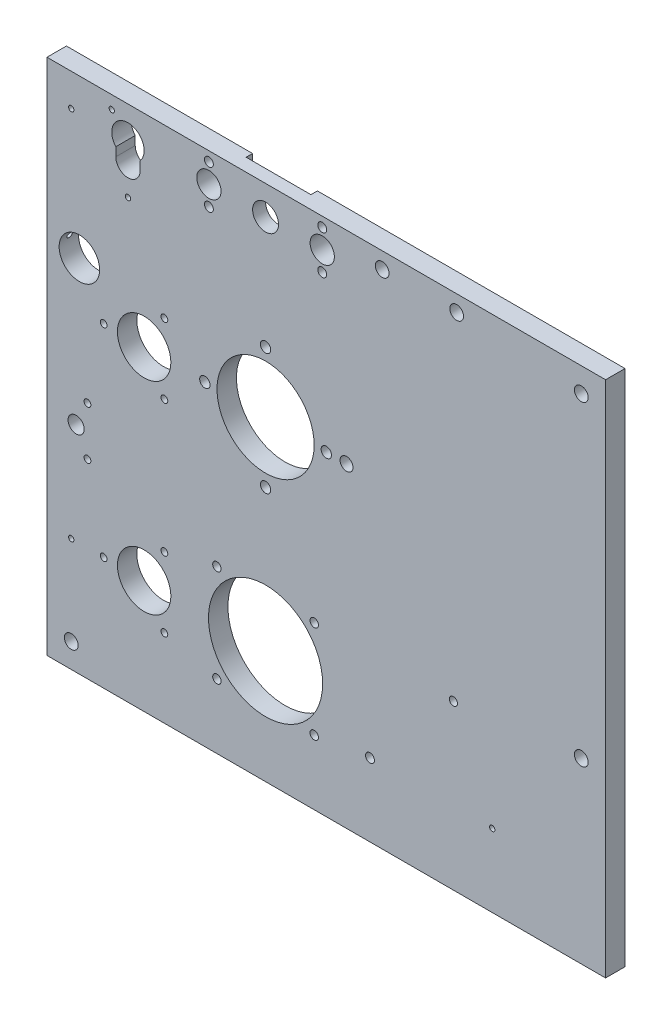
ISO-10303-21;
HEADER;
FILE_DESCRIPTION(('STEP AP214'),'2;1');
FILE_NAME('part.step','',(''),(''),'','','');
FILE_SCHEMA(('AUTOMOTIVE_DESIGN { 1 0 10303 214 1 1 1 1 }'));
ENDSEC;
DATA;
#1=APPLICATION_CONTEXT('core data for automotive mechanical design processes');
#2=APPLICATION_PROTOCOL_DEFINITION('international standard','automotive_design',2000,#1);
#3=PRODUCT_CONTEXT('',#1,'mechanical');
#4=PRODUCT('Part','Part','',(#3));
#5=PRODUCT_RELATED_PRODUCT_CATEGORY('part','',(#4));
#6=PRODUCT_DEFINITION_FORMATION('','',#4);
#7=PRODUCT_DEFINITION_CONTEXT('part definition',#1,'design');
#8=PRODUCT_DEFINITION('design','',#6,#7);
#9=PRODUCT_DEFINITION_SHAPE('','',#8);
#10=(LENGTH_UNIT() NAMED_UNIT(*) SI_UNIT(.MILLI.,.METRE.));
#11=(NAMED_UNIT(*) PLANE_ANGLE_UNIT() SI_UNIT($,.RADIAN.));
#12=(NAMED_UNIT(*) SI_UNIT($,.STERADIAN.) SOLID_ANGLE_UNIT());
#13=UNCERTAINTY_MEASURE_WITH_UNIT(LENGTH_MEASURE(1.E-05),#10,'distance_accuracy_value','');
#14=(GEOMETRIC_REPRESENTATION_CONTEXT(3) GLOBAL_UNCERTAINTY_ASSIGNED_CONTEXT((#13)) GLOBAL_UNIT_ASSIGNED_CONTEXT((#10,
#11,#12)) REPRESENTATION_CONTEXT('',''));
#15=CARTESIAN_POINT('',(0.,0.,0.));
#16=DIRECTION('',(0.,0.,1.));
#17=DIRECTION('',(1.,0.,0.));
#18=AXIS2_PLACEMENT_3D('',#15,#16,#17);
#19=CARTESIAN_POINT('',(135.,302.,-12.));
#20=DIRECTION('',(0.,0.,1.));
#21=DIRECTION('',(1.,0.,0.));
#22=AXIS2_PLACEMENT_3D('',#19,#20,#21);
#23=CYLINDRICAL_SURFACE('',#22,8.00000000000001);
#24=CARTESIAN_POINT('',(135.,302.,0.));
#25=DIRECTION('',(0.,0.,1.));
#26=DIRECTION('',(1.,0.,0.));
#27=AXIS2_PLACEMENT_3D('',#24,#25,#26);
#28=CIRCLE('',#27,8.00000000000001);
#29=CARTESIAN_POINT('',(143.,302.,0.));
#30=VERTEX_POINT('',#29);
#31=EDGE_CURVE('E235',#30,#30,#28,.T.);
#32=ORIENTED_EDGE('',*,*,#31,.T.);
#33=EDGE_LOOP('',(#32));
#34=FACE_BOUND('',#33,.T.);
#35=CARTESIAN_POINT('',(135.,302.,-8.));
#36=DIRECTION('',(0.,0.,-1.));
#37=DIRECTION('',(-1.,0.,0.));
#38=AXIS2_PLACEMENT_3D('',#35,#36,#37);
#39=CIRCLE('',#38,8.00000000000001);
#40=CARTESIAN_POINT('',(127.,302.,-8.));
#41=VERTEX_POINT('',#40);
#42=EDGE_CURVE('E192',#41,#41,#39,.F.);
#43=ORIENTED_EDGE('',*,*,#42,.F.);
#44=EDGE_LOOP('',(#43));
#45=FACE_BOUND('',#44,.T.);
#46=ADVANCED_FACE('F40',(#34,#45),#23,.F.);
#47=CARTESIAN_POINT('',(0.,0.,-12.));
#48=DIRECTION('',(1.,0.,0.));
#49=DIRECTION('',(0.,1.,0.));
#50=AXIS2_PLACEMENT_3D('',#47,#48,#49);
#51=PLANE('',#50);
#52=CARTESIAN_POINT('',(1.66533453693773E-13,226.,-6.));
#53=DIRECTION('',(-1.,0.,0.));
#54=DIRECTION('',(0.,0.,1.));
#55=AXIS2_PLACEMENT_3D('',#52,#53,#54);
#56=CIRCLE('',#55,1.64999999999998);
#57=CARTESIAN_POINT('',(1.66533453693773E-13,226.,-4.35000000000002));
#58=VERTEX_POINT('',#57);
#59=EDGE_CURVE('E158',#58,#58,#56,.T.);
#60=ORIENTED_EDGE('',*,*,#59,.F.);
#61=EDGE_LOOP('',(#60));
#62=FACE_BOUND('',#61,.T.);
#63=CARTESIAN_POINT('',(1.66533453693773E-13,260.,-6.));
#64=DIRECTION('',(-1.,0.,0.));
#65=DIRECTION('',(0.,0.,1.));
#66=AXIS2_PLACEMENT_3D('',#63,#64,#65);
#67=CIRCLE('',#66,1.64999999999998);
#68=CARTESIAN_POINT('',(1.66533453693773E-13,260.,-4.35000000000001));
#69=VERTEX_POINT('',#68);
#70=EDGE_CURVE('E152',#69,#69,#67,.T.);
#71=ORIENTED_EDGE('',*,*,#70,.F.);
#72=EDGE_LOOP('',(#71));
#73=FACE_BOUND('',#72,.T.);
#74=DIRECTION('',(0.,1.,0.));
#75=VECTOR('',#74,1.);
#76=CARTESIAN_POINT('',(0.,0.,0.));
#77=LINE('',#76,#75);
#78=CARTESIAN_POINT('',(0.,0.,0.));
#79=VERTEX_POINT('',#78);
#80=CARTESIAN_POINT('',(1.66533453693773E-13,320.,0.));
#81=VERTEX_POINT('',#80);
#82=EDGE_CURVE('E485',#79,#81,#77,.T.);
#83=ORIENTED_EDGE('',*,*,#82,.T.);
#84=DIRECTION('',(0.,0.,1.));
#85=VECTOR('',#84,1.);
#86=CARTESIAN_POINT('',(1.66533453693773E-13,320.,-12.));
#87=LINE('',#86,#85);
#88=CARTESIAN_POINT('',(1.66533453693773E-13,320.,-12.));
#89=VERTEX_POINT('',#88);
#90=EDGE_CURVE('E11',#89,#81,#87,.T.);
#91=ORIENTED_EDGE('',*,*,#90,.F.);
#92=DIRECTION('',(0.,1.,0.));
#93=VECTOR('',#92,1.);
#94=CARTESIAN_POINT('',(0.,0.,-12.));
#95=LINE('',#94,#93);
#96=CARTESIAN_POINT('',(0.,0.,-12.));
#97=VERTEX_POINT('',#96);
#98=EDGE_CURVE('E499',#97,#89,#95,.T.);
#99=ORIENTED_EDGE('',*,*,#98,.F.);
#100=DIRECTION('',(0.,0.,1.));
#101=VECTOR('',#100,1.);
#102=CARTESIAN_POINT('',(0.,0.,-12.));
#103=LINE('',#102,#101);
#104=EDGE_CURVE('E511',#97,#79,#103,.T.);
#105=ORIENTED_EDGE('',*,*,#104,.T.);
#106=EDGE_LOOP('',(#83,#91,#99,#105));
#107=FACE_BOUND('',#106,.T.);
#108=ADVANCED_FACE('F42',(#62,#73,#107),#51,.F.);
#109=CARTESIAN_POINT('',(345.,320.,-12.));
#110=DIRECTION('',(0.,1.,0.));
#111=DIRECTION('',(0.,0.,1.));
#112=AXIS2_PLACEMENT_3D('',#109,#110,#111);
#113=PLANE('',#112);
#114=DIRECTION('',(0.,0.,-1.));
#115=VECTOR('',#114,1.);
#116=CARTESIAN_POINT('',(155.,320.,-8.));
#117=LINE('',#116,#115);
#118=CARTESIAN_POINT('',(155.,320.,-8.));
#119=VERTEX_POINT('',#118);
#120=CARTESIAN_POINT('',(155.,320.,-12.));
#121=VERTEX_POINT('',#120);
#122=EDGE_CURVE('E193',#119,#121,#117,.T.);
#123=ORIENTED_EDGE('',*,*,#122,.F.);
#124=DIRECTION('',(1.,0.,0.));
#125=VECTOR('',#124,1.);
#126=CARTESIAN_POINT('',(155.,320.,-8.));
#127=LINE('',#126,#125);
#128=CARTESIAN_POINT('',(115.,320.,-8.));
#129=VERTEX_POINT('',#128);
#130=EDGE_CURVE('E184',#129,#119,#127,.T.);
#131=ORIENTED_EDGE('',*,*,#130,.F.);
#132=DIRECTION('',(0.,0.,-1.));
#133=VECTOR('',#132,1.);
#134=CARTESIAN_POINT('',(115.,320.,-8.));
#135=LINE('',#134,#133);
#136=CARTESIAN_POINT('',(115.,320.,-12.));
#137=VERTEX_POINT('',#136);
#138=EDGE_CURVE('E195',#129,#137,#135,.T.);
#139=ORIENTED_EDGE('',*,*,#138,.T.);
#140=DIRECTION('',(-1.,0.,0.));
#141=VECTOR('',#140,1.);
#142=CARTESIAN_POINT('',(345.,320.,-12.));
#143=LINE('',#142,#141);
#144=EDGE_CURVE('E502',#137,#89,#143,.T.);
#145=ORIENTED_EDGE('',*,*,#144,.T.);
#146=ORIENTED_EDGE('',*,*,#90,.T.);
#147=DIRECTION('',(-1.,0.,0.));
#148=VECTOR('',#147,1.);
#149=CARTESIAN_POINT('',(345.,320.,0.));
#150=LINE('',#149,#148);
#151=CARTESIAN_POINT('',(345.,320.,0.));
#152=VERTEX_POINT('',#151);
#153=EDGE_CURVE('E488',#152,#81,#150,.T.);
#154=ORIENTED_EDGE('',*,*,#153,.F.);
#155=DIRECTION('',(0.,0.,1.));
#156=VECTOR('',#155,1.);
#157=CARTESIAN_POINT('',(345.,320.,-12.));
#158=LINE('',#157,#156);
#159=CARTESIAN_POINT('',(345.,320.,-12.));
#160=VERTEX_POINT('',#159);
#161=EDGE_CURVE('E54',#160,#152,#158,.T.);
#162=ORIENTED_EDGE('',*,*,#161,.F.);
#163=EDGE_CURVE('E503',#160,#121,#143,.T.);
#164=ORIENTED_EDGE('',*,*,#163,.T.);
#165=EDGE_LOOP('',(#123,#131,#139,#145,#146,#154,#162,#164));
#166=FACE_BOUND('',#165,.T.);
#167=ADVANCED_FACE('F534',(#166),#113,.T.);
#168=CARTESIAN_POINT('',(345.,320.,-12.));
#169=DIRECTION('',(-1.,0.,0.));
#170=DIRECTION('',(0.,0.,1.));
#171=AXIS2_PLACEMENT_3D('',#168,#169,#170);
#172=PLANE('',#171);
#173=DIRECTION('',(0.,-1.,0.));
#174=VECTOR('',#173,1.);
#175=CARTESIAN_POINT('',(345.,320.,0.));
#176=LINE('',#175,#174);
#177=CARTESIAN_POINT('',(345.,0.,0.));
#178=VERTEX_POINT('',#177);
#179=EDGE_CURVE('E491',#152,#178,#176,.T.);
#180=ORIENTED_EDGE('',*,*,#179,.T.);
#181=DIRECTION('',(0.,0.,1.));
#182=VECTOR('',#181,1.);
#183=CARTESIAN_POINT('',(345.,0.,-12.));
#184=LINE('',#183,#182);
#185=CARTESIAN_POINT('',(345.,0.,-12.));
#186=VERTEX_POINT('',#185);
#187=EDGE_CURVE('E513',#186,#178,#184,.T.);
#188=ORIENTED_EDGE('',*,*,#187,.F.);
#189=DIRECTION('',(0.,-1.,0.));
#190=VECTOR('',#189,1.);
#191=CARTESIAN_POINT('',(345.,320.,-12.));
#192=LINE('',#191,#190);
#193=EDGE_CURVE('E506',#160,#186,#192,.T.);
#194=ORIENTED_EDGE('',*,*,#193,.F.);
#195=ORIENTED_EDGE('',*,*,#161,.T.);
#196=EDGE_LOOP('',(#180,#188,#194,#195));
#197=FACE_BOUND('',#196,.T.);
#198=ADVANCED_FACE('F722',(#197),#172,.F.);
#199=CARTESIAN_POINT('',(0.,0.,-12.));
#200=DIRECTION('',(0.,-1.,0.));
#201=DIRECTION('',(1.,0.,0.));
#202=AXIS2_PLACEMENT_3D('',#199,#200,#201);
#203=PLANE('',#202);
#204=CARTESIAN_POINT('',(59.9999999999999,0.,-5.99999999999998));
#205=DIRECTION('',(0.,-1.,0.));
#206=DIRECTION('',(0.,0.,-1.));
#207=AXIS2_PLACEMENT_3D('',#204,#205,#206);
#208=CIRCLE('',#207,1.64999999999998);
#209=CARTESIAN_POINT('',(59.9999999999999,0.,-7.64999999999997));
#210=VERTEX_POINT('',#209);
#211=EDGE_CURVE('E155',#210,#210,#208,.T.);
#212=ORIENTED_EDGE('',*,*,#211,.F.);
#213=EDGE_LOOP('',(#212));
#214=FACE_BOUND('',#213,.T.);
#215=CARTESIAN_POINT('',(205.,0.,-5.99999999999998));
#216=DIRECTION('',(0.,-1.,0.));
#217=DIRECTION('',(0.,0.,-1.));
#218=AXIS2_PLACEMENT_3D('',#215,#216,#217);
#219=CIRCLE('',#218,1.64999999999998);
#220=CARTESIAN_POINT('',(205.,0.,-7.64999999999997));
#221=VERTEX_POINT('',#220);
#222=EDGE_CURVE('E169',#221,#221,#219,.T.);
#223=ORIENTED_EDGE('',*,*,#222,.F.);
#224=EDGE_LOOP('',(#223));
#225=FACE_BOUND('',#224,.T.);
#226=DIRECTION('',(1.,0.,0.));
#227=VECTOR('',#226,1.);
#228=CARTESIAN_POINT('',(0.,0.,0.));
#229=LINE('',#228,#227);
#230=EDGE_CURVE('E495',#79,#178,#229,.T.);
#231=ORIENTED_EDGE('',*,*,#230,.F.);
#232=ORIENTED_EDGE('',*,*,#104,.F.);
#233=DIRECTION('',(1.,0.,0.));
#234=VECTOR('',#233,1.);
#235=CARTESIAN_POINT('',(0.,0.,-12.));
#236=LINE('',#235,#234);
#237=EDGE_CURVE('E508',#97,#186,#236,.T.);
#238=ORIENTED_EDGE('',*,*,#237,.T.);
#239=ORIENTED_EDGE('',*,*,#187,.T.);
#240=EDGE_LOOP('',(#231,#232,#238,#239));
#241=FACE_BOUND('',#240,.T.);
#242=ADVANCED_FACE('F718',(#214,#225,#241),#203,.T.);
#243=CARTESIAN_POINT('',(1.66533453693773E-13,320.,-12.));
#244=DIRECTION('',(0.,0.,1.));
#245=DIRECTION('',(1.,0.,0.));
#246=AXIS2_PLACEMENT_3D('',#243,#244,#245);
#247=PLANE('',#246);
#248=CARTESIAN_POINT('',(170.,290.,-12.));
#249=DIRECTION('',(0.,0.,1.));
#250=DIRECTION('',(1.,0.,0.));
#251=AXIS2_PLACEMENT_3D('',#248,#249,#250);
#252=CIRCLE('',#251,2.75000000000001);
#253=CARTESIAN_POINT('',(172.75,290.,-12.));
#254=VERTEX_POINT('',#253);
#255=EDGE_CURVE('E202',#254,#254,#252,.T.);
#256=ORIENTED_EDGE('',*,*,#255,.T.);
#257=EDGE_LOOP('',(#256));
#258=FACE_BOUND('',#257,.T.);
#259=CARTESIAN_POINT('',(170.,314.,-12.));
#260=DIRECTION('',(0.,0.,1.));
#261=DIRECTION('',(1.,0.,0.));
#262=AXIS2_PLACEMENT_3D('',#259,#260,#261);
#263=CIRCLE('',#262,2.75000000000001);
#264=CARTESIAN_POINT('',(172.75,314.,-12.));
#265=VERTEX_POINT('',#264);
#266=EDGE_CURVE('E208',#265,#265,#263,.T.);
#267=ORIENTED_EDGE('',*,*,#266,.T.);
#268=EDGE_LOOP('',(#267));
#269=FACE_BOUND('',#268,.T.);
#270=CARTESIAN_POINT('',(100.,290.,-12.));
#271=DIRECTION('',(0.,0.,1.));
#272=DIRECTION('',(1.,0.,0.));
#273=AXIS2_PLACEMENT_3D('',#270,#271,#272);
#274=CIRCLE('',#273,2.75000000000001);
#275=CARTESIAN_POINT('',(102.75,290.,-12.));
#276=VERTEX_POINT('',#275);
#277=EDGE_CURVE('E214',#276,#276,#274,.T.);
#278=ORIENTED_EDGE('',*,*,#277,.T.);
#279=EDGE_LOOP('',(#278));
#280=FACE_BOUND('',#279,.T.);
#281=CARTESIAN_POINT('',(100.,314.,-12.));
#282=DIRECTION('',(0.,0.,1.));
#283=DIRECTION('',(1.,0.,0.));
#284=AXIS2_PLACEMENT_3D('',#281,#282,#283);
#285=CIRCLE('',#284,2.75000000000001);
#286=CARTESIAN_POINT('',(102.75,314.,-12.));
#287=VERTEX_POINT('',#286);
#288=EDGE_CURVE('E220',#287,#287,#285,.T.);
#289=ORIENTED_EDGE('',*,*,#288,.T.);
#290=EDGE_LOOP('',(#289));
#291=FACE_BOUND('',#290,.T.);
#292=CARTESIAN_POINT('',(170.,302.,-12.));
#293=DIRECTION('',(0.,0.,1.));
#294=DIRECTION('',(1.,0.,0.));
#295=AXIS2_PLACEMENT_3D('',#292,#293,#294);
#296=CIRCLE('',#295,7.50000000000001);
#297=CARTESIAN_POINT('',(177.5,302.,-12.));
#298=VERTEX_POINT('',#297);
#299=EDGE_CURVE('E226',#298,#298,#296,.T.);
#300=ORIENTED_EDGE('',*,*,#299,.T.);
#301=EDGE_LOOP('',(#300));
#302=FACE_BOUND('',#301,.T.);
#303=CARTESIAN_POINT('',(100.,302.,-12.));
#304=DIRECTION('',(0.,0.,1.));
#305=DIRECTION('',(1.,0.,0.));
#306=AXIS2_PLACEMENT_3D('',#303,#304,#305);
#307=CIRCLE('',#306,7.50000000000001);
#308=CARTESIAN_POINT('',(107.5,302.,-12.));
#309=VERTEX_POINT('',#308);
#310=EDGE_CURVE('E232',#309,#309,#307,.T.);
#311=ORIENTED_EDGE('',*,*,#310,.T.);
#312=EDGE_LOOP('',(#311));
#313=FACE_BOUND('',#312,.T.);
#314=CARTESIAN_POINT('',(251.,101.,-12.));
#315=DIRECTION('',(0.,0.,1.));
#316=DIRECTION('',(1.,0.,0.));
#317=AXIS2_PLACEMENT_3D('',#314,#315,#316);
#318=CIRCLE('',#317,2.5);
#319=CARTESIAN_POINT('',(253.5,101.,-12.));
#320=VERTEX_POINT('',#319);
#321=EDGE_CURVE('E241',#320,#320,#318,.T.);
#322=ORIENTED_EDGE('',*,*,#321,.T.);
#323=EDGE_LOOP('',(#322));
#324=FACE_BOUND('',#323,.T.);
#325=CARTESIAN_POINT('',(275.,45.,-12.));
#326=DIRECTION('',(0.,0.,1.));
#327=DIRECTION('',(1.,0.,0.));
#328=AXIS2_PLACEMENT_3D('',#325,#326,#327);
#329=CIRCLE('',#328,1.14999999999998);
#330=CARTESIAN_POINT('',(276.15,45.,-12.));
#331=VERTEX_POINT('',#330);
#332=EDGE_CURVE('E250',#331,#331,#329,.T.);
#333=ORIENTED_EDGE('',*,*,#332,.T.);
#334=EDGE_LOOP('',(#333));
#335=FACE_BOUND('',#334,.T.);
#336=CARTESIAN_POINT('',(15.,70.,-12.));
#337=DIRECTION('',(0.,0.,1.));
#338=DIRECTION('',(1.,0.,0.));
#339=AXIS2_PLACEMENT_3D('',#336,#337,#338);
#340=CIRCLE('',#339,1.14999999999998);
#341=CARTESIAN_POINT('',(16.15,70.,-12.));
#342=VERTEX_POINT('',#341);
#343=EDGE_CURVE('E257',#342,#342,#340,.T.);
#344=ORIENTED_EDGE('',*,*,#343,.T.);
#345=EDGE_LOOP('',(#344));
#346=FACE_BOUND('',#345,.T.);
#347=CARTESIAN_POINT('',(330.,110.,-12.));
#348=DIRECTION('',(0.,0.,1.));
#349=DIRECTION('',(1.,0.,0.));
#350=AXIS2_PLACEMENT_3D('',#347,#348,#349);
#351=CIRCLE('',#350,4.24999999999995);
#352=CARTESIAN_POINT('',(334.25,110.,-12.));
#353=VERTEX_POINT('',#352);
#354=EDGE_CURVE('E261',#353,#353,#351,.T.);
#355=ORIENTED_EDGE('',*,*,#354,.T.);
#356=EDGE_LOOP('',(#355));
#357=FACE_BOUND('',#356,.T.);
#358=CARTESIAN_POINT('',(207.,310.,-12.));
#359=DIRECTION('',(0.,0.,1.));
#360=DIRECTION('',(1.,0.,0.));
#361=AXIS2_PLACEMENT_3D('',#358,#359,#360);
#362=CIRCLE('',#361,4.25000000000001);
#363=CARTESIAN_POINT('',(211.25,310.,-12.));
#364=VERTEX_POINT('',#363);
#365=EDGE_CURVE('E267',#364,#364,#362,.T.);
#366=ORIENTED_EDGE('',*,*,#365,.T.);
#367=EDGE_LOOP('',(#366));
#368=FACE_BOUND('',#367,.T.);
#369=CARTESIAN_POINT('',(253.,310.,-12.));
#370=DIRECTION('',(0.,0.,1.));
#371=DIRECTION('',(1.,0.,0.));
#372=AXIS2_PLACEMENT_3D('',#369,#370,#371);
#373=CIRCLE('',#372,4.25000000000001);
#374=CARTESIAN_POINT('',(257.25,310.,-12.));
#375=VERTEX_POINT('',#374);
#376=EDGE_CURVE('E273',#375,#375,#373,.T.);
#377=ORIENTED_EDGE('',*,*,#376,.T.);
#378=EDGE_LOOP('',(#377));
#379=FACE_BOUND('',#378,.T.);
#380=CARTESIAN_POINT('',(185.,195.,-12.));
#381=DIRECTION('',(0.,0.,1.));
#382=DIRECTION('',(1.,0.,0.));
#383=AXIS2_PLACEMENT_3D('',#380,#381,#382);
#384=CIRCLE('',#383,3.99999999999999);
#385=CARTESIAN_POINT('',(189.,195.,-12.));
#386=VERTEX_POINT('',#385);
#387=EDGE_CURVE('E279',#386,#386,#384,.T.);
#388=ORIENTED_EDGE('',*,*,#387,.T.);
#389=EDGE_LOOP('',(#388));
#390=FACE_BOUND('',#389,.T.);
#391=CARTESIAN_POINT('',(330.,305.,-12.));
#392=DIRECTION('',(0.,0.,1.));
#393=DIRECTION('',(1.,0.,0.));
#394=AXIS2_PLACEMENT_3D('',#391,#392,#393);
#395=CIRCLE('',#394,4.24999999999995);
#396=CARTESIAN_POINT('',(334.25,305.,-12.));
#397=VERTEX_POINT('',#396);
#398=EDGE_CURVE('E285',#397,#397,#395,.T.);
#399=ORIENTED_EDGE('',*,*,#398,.T.);
#400=EDGE_LOOP('',(#399));
#401=FACE_BOUND('',#400,.T.);
#402=CARTESIAN_POINT('',(199.5,45.,-12.));
#403=DIRECTION('',(0.,0.,1.));
#404=DIRECTION('',(1.,0.,0.));
#405=AXIS2_PLACEMENT_3D('',#402,#403,#404);
#406=CIRCLE('',#405,2.75000000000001);
#407=CARTESIAN_POINT('',(202.25,45.,-12.));
#408=VERTEX_POINT('',#407);
#409=EDGE_CURVE('E292',#408,#408,#406,.T.);
#410=ORIENTED_EDGE('',*,*,#409,.T.);
#411=EDGE_LOOP('',(#410));
#412=FACE_BOUND('',#411,.T.);
#413=CARTESIAN_POINT('',(15.,15.,-12.));
#414=DIRECTION('',(0.,0.,1.));
#415=DIRECTION('',(1.,0.,0.));
#416=AXIS2_PLACEMENT_3D('',#413,#414,#415);
#417=CIRCLE('',#416,4.25);
#418=CARTESIAN_POINT('',(19.25,15.,-12.));
#419=VERTEX_POINT('',#418);
#420=EDGE_CURVE('E299',#419,#419,#417,.T.);
#421=ORIENTED_EDGE('',*,*,#420,.T.);
#422=EDGE_LOOP('',(#421));
#423=FACE_BOUND('',#422,.T.);
#424=CARTESIAN_POINT('',(25.,117.5,-12.));
#425=DIRECTION('',(0.,0.,1.));
#426=DIRECTION('',(1.,0.,0.));
#427=AXIS2_PLACEMENT_3D('',#424,#425,#426);
#428=CIRCLE('',#427,2.1);
#429=CARTESIAN_POINT('',(27.1,117.5,-12.));
#430=VERTEX_POINT('',#429);
#431=EDGE_CURVE('E305',#430,#430,#428,.T.);
#432=ORIENTED_EDGE('',*,*,#431,.T.);
#433=EDGE_LOOP('',(#432));
#434=FACE_BOUND('',#433,.T.);
#435=CARTESIAN_POINT('',(25.,147.5,-12.));
#436=DIRECTION('',(0.,0.,1.));
#437=DIRECTION('',(1.,0.,0.));
#438=AXIS2_PLACEMENT_3D('',#435,#436,#437);
#439=CIRCLE('',#438,2.09999999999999);
#440=CARTESIAN_POINT('',(27.1,147.5,-12.));
#441=VERTEX_POINT('',#440);
#442=EDGE_CURVE('E311',#441,#441,#439,.T.);
#443=ORIENTED_EDGE('',*,*,#442,.T.);
#444=EDGE_LOOP('',(#443));
#445=FACE_BOUND('',#444,.T.);
#446=CARTESIAN_POINT('',(18.,132.5,-12.));
#447=DIRECTION('',(0.,0.,1.));
#448=DIRECTION('',(1.,0.,0.));
#449=AXIS2_PLACEMENT_3D('',#446,#447,#448);
#450=CIRCLE('',#449,5.);
#451=CARTESIAN_POINT('',(23.,132.5,-12.));
#452=VERTEX_POINT('',#451);
#453=EDGE_CURVE('E317',#452,#452,#450,.T.);
#454=ORIENTED_EDGE('',*,*,#453,.T.);
#455=EDGE_LOOP('',(#454));
#456=FACE_BOUND('',#455,.T.);
#457=DIRECTION('',(0.,-1.,0.));
#458=VECTOR('',#457,1.);
#459=CARTESIAN_POINT('',(42.5000000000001,288.,-12.));
#460=LINE('',#459,#458);
#461=CARTESIAN_POINT('',(42.5000000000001,293.385621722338,-12.));
#462=VERTEX_POINT('',#461);
#463=CARTESIAN_POINT('',(42.5000000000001,288.,-12.));
#464=VERTEX_POINT('',#463);
#465=EDGE_CURVE('E338',#462,#464,#460,.T.);
#466=ORIENTED_EDGE('',*,*,#465,.T.);
#467=CARTESIAN_POINT('',(50.0000000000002,288.,-12.));
#468=DIRECTION('',(0.,0.,1.));
#469=DIRECTION('',(1.,0.,0.));
#470=AXIS2_PLACEMENT_3D('',#467,#468,#469);
#471=CIRCLE('',#470,7.5);
#472=CARTESIAN_POINT('',(57.5000000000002,288.,-12.));
#473=VERTEX_POINT('',#472);
#474=EDGE_CURVE('E331',#464,#473,#471,.T.);
#475=ORIENTED_EDGE('',*,*,#474,.T.);
#476=DIRECTION('',(0.,1.,0.));
#477=VECTOR('',#476,1.);
#478=CARTESIAN_POINT('',(57.5000000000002,288.,-12.));
#479=LINE('',#478,#477);
#480=CARTESIAN_POINT('',(57.5000000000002,293.385621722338,-12.));
#481=VERTEX_POINT('',#480);
#482=EDGE_CURVE('E334',#473,#481,#479,.T.);
#483=ORIENTED_EDGE('',*,*,#482,.T.);
#484=CARTESIAN_POINT('',(50.0000000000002,300.,-12.));
#485=DIRECTION('',(0.,0.,1.));
#486=DIRECTION('',(1.,0.,0.));
#487=AXIS2_PLACEMENT_3D('',#484,#485,#486);
#488=CIRCLE('',#487,10.);
#489=EDGE_CURVE('E70',#481,#462,#488,.T.);
#490=ORIENTED_EDGE('',*,*,#489,.T.);
#491=EDGE_LOOP('',(#466,#475,#483,#490));
#492=FACE_BOUND('',#491,.T.);
#493=CARTESIAN_POINT('',(15.0000000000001,300.,-12.));
#494=DIRECTION('',(0.,0.,1.));
#495=DIRECTION('',(1.,0.,0.));
#496=AXIS2_PLACEMENT_3D('',#493,#494,#495);
#497=CIRCLE('',#496,1.14999999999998);
#498=CARTESIAN_POINT('',(16.1500000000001,300.,-12.));
#499=VERTEX_POINT('',#498);
#500=EDGE_CURVE('E356',#499,#499,#497,.T.);
#501=ORIENTED_EDGE('',*,*,#500,.T.);
#502=EDGE_LOOP('',(#501));
#503=FACE_BOUND('',#502,.T.);
#504=CARTESIAN_POINT('',(50.0000000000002,270.,-12.));
#505=DIRECTION('',(0.,0.,1.));
#506=DIRECTION('',(1.,0.,0.));
#507=AXIS2_PLACEMENT_3D('',#504,#505,#506);
#508=CIRCLE('',#507,1.14999999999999);
#509=CARTESIAN_POINT('',(51.1500000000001,270.,-12.));
#510=VERTEX_POINT('',#509);
#511=EDGE_CURVE('E363',#510,#510,#508,.T.);
#512=ORIENTED_EDGE('',*,*,#511,.T.);
#513=EDGE_LOOP('',(#512));
#514=FACE_BOUND('',#513,.T.);
#515=CARTESIAN_POINT('',(40.0000000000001,312.,-12.));
#516=DIRECTION('',(0.,0.,1.));
#517=DIRECTION('',(1.,0.,0.));
#518=AXIS2_PLACEMENT_3D('',#515,#516,#517);
#519=CIRCLE('',#518,1.65);
#520=CARTESIAN_POINT('',(41.6500000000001,312.,-12.));
#521=VERTEX_POINT('',#520);
#522=EDGE_CURVE('E364',#521,#521,#519,.T.);
#523=ORIENTED_EDGE('',*,*,#522,.T.);
#524=EDGE_LOOP('',(#523));
#525=FACE_BOUND('',#524,.T.);
#526=CARTESIAN_POINT('',(20.0000000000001,222.5,-12.));
#527=DIRECTION('',(0.,0.,1.));
#528=DIRECTION('',(1.,0.,0.));
#529=AXIS2_PLACEMENT_3D('',#526,#527,#528);
#530=CIRCLE('',#529,12.5);
#531=CARTESIAN_POINT('',(32.5000000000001,222.5,-12.));
#532=VERTEX_POINT('',#531);
#533=EDGE_CURVE('E373',#532,#532,#530,.T.);
#534=ORIENTED_EDGE('',*,*,#533,.T.);
#535=EDGE_LOOP('',(#534));
#536=FACE_BOUND('',#535,.T.);
#537=CARTESIAN_POINT('',(35.,70.,-12.));
#538=DIRECTION('',(0.,0.,1.));
#539=DIRECTION('',(1.,0.,0.));
#540=AXIS2_PLACEMENT_3D('',#537,#538,#539);
#541=CIRCLE('',#540,2.09999999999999);
#542=CARTESIAN_POINT('',(37.1,70.,-12.));
#543=VERTEX_POINT('',#542);
#544=EDGE_CURVE('E376',#543,#543,#541,.T.);
#545=ORIENTED_EDGE('',*,*,#544,.T.);
#546=EDGE_LOOP('',(#545));
#547=FACE_BOUND('',#546,.T.);
#548=CARTESIAN_POINT('',(72.5,91.6506350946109,-12.));
#549=DIRECTION('',(0.,0.,1.));
#550=DIRECTION('',(1.,0.,0.));
#551=AXIS2_PLACEMENT_3D('',#548,#549,#550);
#552=CIRCLE('',#551,2.1);
#553=CARTESIAN_POINT('',(74.6,91.6506350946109,-12.));
#554=VERTEX_POINT('',#553);
#555=EDGE_CURVE('E382',#554,#554,#552,.T.);
#556=ORIENTED_EDGE('',*,*,#555,.T.);
#557=EDGE_LOOP('',(#556));
#558=FACE_BOUND('',#557,.T.);
#559=CARTESIAN_POINT('',(72.5000000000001,48.3493649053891,-12.));
#560=DIRECTION('',(0.,0.,1.));
#561=DIRECTION('',(1.,0.,0.));
#562=AXIS2_PLACEMENT_3D('',#559,#560,#561);
#563=CIRCLE('',#562,2.09999999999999);
#564=CARTESIAN_POINT('',(74.6000000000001,48.3493649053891,-12.));
#565=VERTEX_POINT('',#564);
#566=EDGE_CURVE('E388',#565,#565,#563,.T.);
#567=ORIENTED_EDGE('',*,*,#566,.T.);
#568=EDGE_LOOP('',(#567));
#569=FACE_BOUND('',#568,.T.);
#570=CARTESIAN_POINT('',(72.5000000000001,173.349364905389,-12.));
#571=DIRECTION('',(0.,0.,1.));
#572=DIRECTION('',(1.,0.,0.));
#573=AXIS2_PLACEMENT_3D('',#570,#571,#572);
#574=CIRCLE('',#573,2.09999999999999);
#575=CARTESIAN_POINT('',(74.6000000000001,173.349364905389,-12.));
#576=VERTEX_POINT('',#575);
#577=EDGE_CURVE('E397',#576,#576,#574,.T.);
#578=ORIENTED_EDGE('',*,*,#577,.T.);
#579=EDGE_LOOP('',(#578));
#580=FACE_BOUND('',#579,.T.);
#581=CARTESIAN_POINT('',(35.,195.,-12.));
#582=DIRECTION('',(0.,0.,1.));
#583=DIRECTION('',(1.,0.,0.));
#584=AXIS2_PLACEMENT_3D('',#581,#582,#583);
#585=CIRCLE('',#584,2.09999999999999);
#586=CARTESIAN_POINT('',(37.1,195.,-12.));
#587=VERTEX_POINT('',#586);
#588=EDGE_CURVE('E403',#587,#587,#585,.T.);
#589=ORIENTED_EDGE('',*,*,#588,.T.);
#590=EDGE_LOOP('',(#589));
#591=FACE_BOUND('',#590,.T.);
#592=CARTESIAN_POINT('',(72.5,216.650635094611,-12.));
#593=DIRECTION('',(0.,0.,1.));
#594=DIRECTION('',(1.,0.,0.));
#595=AXIS2_PLACEMENT_3D('',#592,#593,#594);
#596=CIRCLE('',#595,2.1);
#597=CARTESIAN_POINT('',(74.6,216.650635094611,-12.));
#598=VERTEX_POINT('',#597);
#599=EDGE_CURVE('E409',#598,#598,#596,.T.);
#600=ORIENTED_EDGE('',*,*,#599,.T.);
#601=EDGE_LOOP('',(#600));
#602=FACE_BOUND('',#601,.T.);
#603=CARTESIAN_POINT('',(60.,70.,-12.));
#604=DIRECTION('',(0.,0.,1.));
#605=DIRECTION('',(1.,0.,0.));
#606=AXIS2_PLACEMENT_3D('',#603,#604,#605);
#607=CIRCLE('',#606,16.5);
#608=CARTESIAN_POINT('',(76.5,70.,-12.));
#609=VERTEX_POINT('',#608);
#610=EDGE_CURVE('E415',#609,#609,#607,.T.);
#611=ORIENTED_EDGE('',*,*,#610,.T.);
#612=EDGE_LOOP('',(#611));
#613=FACE_BOUND('',#612,.T.);
#614=CARTESIAN_POINT('',(60.0000000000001,195.,-12.));
#615=DIRECTION('',(0.,0.,1.));
#616=DIRECTION('',(1.,0.,0.));
#617=AXIS2_PLACEMENT_3D('',#614,#615,#616);
#618=CIRCLE('',#617,16.5);
#619=CARTESIAN_POINT('',(76.5000000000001,195.,-12.));
#620=VERTEX_POINT('',#619);
#621=EDGE_CURVE('E421',#620,#620,#618,.T.);
#622=ORIENTED_EDGE('',*,*,#621,.T.);
#623=EDGE_LOOP('',(#622));
#624=FACE_BOUND('',#623,.T.);
#625=CARTESIAN_POINT('',(135.,157.5,-12.));
#626=DIRECTION('',(0.,0.,1.));
#627=DIRECTION('',(0.,-1.,0.));
#628=AXIS2_PLACEMENT_3D('',#625,#626,#627);
#629=CIRCLE('',#628,3.19999999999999);
#630=CARTESIAN_POINT('',(135.,154.3,-12.));
#631=VERTEX_POINT('',#630);
#632=EDGE_CURVE('E424',#631,#631,#629,.T.);
#633=ORIENTED_EDGE('',*,*,#632,.T.);
#634=EDGE_LOOP('',(#633));
#635=FACE_BOUND('',#634,.T.);
#636=CARTESIAN_POINT('',(97.4999999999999,195.,-12.));
#637=DIRECTION('',(0.,0.,1.));
#638=DIRECTION('',(-1.,0.,0.));
#639=AXIS2_PLACEMENT_3D('',#636,#637,#638);
#640=CIRCLE('',#639,3.19999999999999);
#641=CARTESIAN_POINT('',(94.2999999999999,195.,-12.));
#642=VERTEX_POINT('',#641);
#643=EDGE_CURVE('E430',#642,#642,#640,.T.);
#644=ORIENTED_EDGE('',*,*,#643,.T.);
#645=EDGE_LOOP('',(#644));
#646=FACE_BOUND('',#645,.T.);
#647=CARTESIAN_POINT('',(135.,232.5,-12.));
#648=DIRECTION('',(0.,0.,1.));
#649=DIRECTION('',(0.,1.,0.));
#650=AXIS2_PLACEMENT_3D('',#647,#648,#649);
#651=CIRCLE('',#650,3.19999999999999);
#652=CARTESIAN_POINT('',(135.,235.7,-12.));
#653=VERTEX_POINT('',#652);
#654=EDGE_CURVE('E436',#653,#653,#651,.T.);
#655=ORIENTED_EDGE('',*,*,#654,.T.);
#656=EDGE_LOOP('',(#655));
#657=FACE_BOUND('',#656,.T.);
#658=CARTESIAN_POINT('',(165.052038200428,100.052038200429,-12.));
#659=DIRECTION('',(0.,0.,1.));
#660=DIRECTION('',(0.,-1.,0.));
#661=AXIS2_PLACEMENT_3D('',#658,#659,#660);
#662=CIRCLE('',#661,2.6);
#663=CARTESIAN_POINT('',(165.052038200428,97.4520382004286,-12.));
#664=VERTEX_POINT('',#663);
#665=EDGE_CURVE('E442',#664,#664,#662,.T.);
#666=ORIENTED_EDGE('',*,*,#665,.T.);
#667=EDGE_LOOP('',(#666));
#668=FACE_BOUND('',#667,.T.);
#669=CARTESIAN_POINT('',(165.052038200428,39.9479617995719,-12.));
#670=DIRECTION('',(0.,0.,1.));
#671=DIRECTION('',(-1.,0.,0.));
#672=AXIS2_PLACEMENT_3D('',#669,#670,#671);
#673=CIRCLE('',#672,2.6);
#674=CARTESIAN_POINT('',(162.452038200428,39.9479617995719,-12.));
#675=VERTEX_POINT('',#674);
#676=EDGE_CURVE('E448',#675,#675,#673,.T.);
#677=ORIENTED_EDGE('',*,*,#676,.T.);
#678=EDGE_LOOP('',(#677));
#679=FACE_BOUND('',#678,.T.);
#680=CARTESIAN_POINT('',(104.947961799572,39.9479617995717,-12.));
#681=DIRECTION('',(0.,0.,1.));
#682=DIRECTION('',(0.,1.,0.));
#683=AXIS2_PLACEMENT_3D('',#680,#681,#682);
#684=CIRCLE('',#683,2.6);
#685=CARTESIAN_POINT('',(104.947961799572,42.5479617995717,-12.));
#686=VERTEX_POINT('',#685);
#687=EDGE_CURVE('E455',#686,#686,#684,.T.);
#688=ORIENTED_EDGE('',*,*,#687,.T.);
#689=EDGE_LOOP('',(#688));
#690=FACE_BOUND('',#689,.T.);
#691=CARTESIAN_POINT('',(104.947961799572,100.052038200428,-12.));
#692=DIRECTION('',(0.,0.,1.));
#693=DIRECTION('',(1.,0.,0.));
#694=AXIS2_PLACEMENT_3D('',#691,#692,#693);
#695=CIRCLE('',#694,2.6);
#696=CARTESIAN_POINT('',(107.547961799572,100.052038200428,-12.));
#697=VERTEX_POINT('',#696);
#698=EDGE_CURVE('E464',#697,#697,#695,.T.);
#699=ORIENTED_EDGE('',*,*,#698,.T.);
#700=EDGE_LOOP('',(#699));
#701=FACE_BOUND('',#700,.T.);
#702=CARTESIAN_POINT('',(172.5,195.,-12.));
#703=DIRECTION('',(0.,0.,1.));
#704=DIRECTION('',(1.,0.,0.));
#705=AXIS2_PLACEMENT_3D('',#702,#703,#704);
#706=CIRCLE('',#705,3.19999999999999);
#707=CARTESIAN_POINT('',(175.7,195.,-12.));
#708=VERTEX_POINT('',#707);
#709=EDGE_CURVE('E470',#708,#708,#706,.T.);
#710=ORIENTED_EDGE('',*,*,#709,.T.);
#711=EDGE_LOOP('',(#710));
#712=FACE_BOUND('',#711,.T.);
#713=CARTESIAN_POINT('',(135.,70.0000000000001,-12.));
#714=DIRECTION('',(0.,0.,1.));
#715=DIRECTION('',(1.,0.,0.));
#716=AXIS2_PLACEMENT_3D('',#713,#714,#715);
#717=CIRCLE('',#716,35.25);
#718=CARTESIAN_POINT('',(170.25,70.0000000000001,-12.));
#719=VERTEX_POINT('',#718);
#720=EDGE_CURVE('E476',#719,#719,#717,.T.);
#721=ORIENTED_EDGE('',*,*,#720,.T.);
#722=EDGE_LOOP('',(#721));
#723=FACE_BOUND('',#722,.T.);
#724=CARTESIAN_POINT('',(135.,195.,-12.));
#725=DIRECTION('',(0.,0.,1.));
#726=DIRECTION('',(1.,0.,0.));
#727=AXIS2_PLACEMENT_3D('',#724,#725,#726);
#728=CIRCLE('',#727,30.);
#729=CARTESIAN_POINT('',(165.,195.,-12.));
#730=VERTEX_POINT('',#729);
#731=EDGE_CURVE('E482',#730,#730,#728,.T.);
#732=ORIENTED_EDGE('',*,*,#731,.T.);
#733=EDGE_LOOP('',(#732));
#734=FACE_BOUND('',#733,.T.);
#735=CARTESIAN_POINT('',(135.,302.,-12.));
#736=DIRECTION('',(0.,0.,-1.));
#737=DIRECTION('',(-1.,0.,0.));
#738=AXIS2_PLACEMENT_3D('',#735,#736,#737);
#739=CIRCLE('',#738,20.);
#740=CARTESIAN_POINT('',(155.,302.,-12.));
#741=VERTEX_POINT('',#740);
#742=CARTESIAN_POINT('',(115.,302.,-12.));
#743=VERTEX_POINT('',#742);
#744=EDGE_CURVE('E62',#741,#743,#739,.T.);
#745=ORIENTED_EDGE('',*,*,#744,.F.);
#746=DIRECTION('',(0.,-1.,0.));
#747=VECTOR('',#746,1.);
#748=CARTESIAN_POINT('',(155.,302.,-12.));
#749=LINE('',#748,#747);
#750=EDGE_CURVE('E175',#121,#741,#749,.T.);
#751=ORIENTED_EDGE('',*,*,#750,.F.);
#752=ORIENTED_EDGE('',*,*,#163,.F.);
#753=ORIENTED_EDGE('',*,*,#193,.T.);
#754=ORIENTED_EDGE('',*,*,#237,.F.);
#755=ORIENTED_EDGE('',*,*,#98,.T.);
#756=ORIENTED_EDGE('',*,*,#144,.F.);
#757=DIRECTION('',(0.,1.,0.));
#758=VECTOR('',#757,1.);
#759=CARTESIAN_POINT('',(115.,302.,-12.));
#760=LINE('',#759,#758);
#761=EDGE_CURVE('E173',#743,#137,#760,.T.);
#762=ORIENTED_EDGE('',*,*,#761,.F.);
#763=EDGE_LOOP('',(#745,#751,#752,#753,#754,#755,#756,#762));
#764=FACE_BOUND('',#763,.T.);
#765=ADVANCED_FACE('F714',(#258,#269,#280,#291,#302,#313,#324,#335,#346,#357,#368,#379,#390,
#401,#412,#423,#434,#445,#456,#492,#503,#514,#525,#536,#547,#558,#569,#580,#591,#602,#613,#624,
#635,#646,#657,#668,#679,#690,#701,#712,#723,#734,#764),#247,.F.);
#766=CARTESIAN_POINT('',(1.66533453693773E-13,320.,0.));
#767=DIRECTION('',(0.,0.,1.));
#768=DIRECTION('',(1.,0.,0.));
#769=AXIS2_PLACEMENT_3D('',#766,#767,#768);
#770=PLANE('',#769);
#771=CARTESIAN_POINT('',(170.,290.,0.));
#772=DIRECTION('',(0.,0.,1.));
#773=DIRECTION('',(1.,0.,0.));
#774=AXIS2_PLACEMENT_3D('',#771,#772,#773);
#775=CIRCLE('',#774,2.75000000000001);
#776=CARTESIAN_POINT('',(172.75,290.,0.));
#777=VERTEX_POINT('',#776);
#778=EDGE_CURVE('E199',#777,#777,#775,.T.);
#779=ORIENTED_EDGE('',*,*,#778,.F.);
#780=EDGE_LOOP('',(#779));
#781=FACE_BOUND('',#780,.T.);
#782=CARTESIAN_POINT('',(170.,314.,0.));
#783=DIRECTION('',(0.,0.,1.));
#784=DIRECTION('',(1.,0.,0.));
#785=AXIS2_PLACEMENT_3D('',#782,#783,#784);
#786=CIRCLE('',#785,2.75000000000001);
#787=CARTESIAN_POINT('',(172.75,314.,0.));
#788=VERTEX_POINT('',#787);
#789=EDGE_CURVE('E205',#788,#788,#786,.T.);
#790=ORIENTED_EDGE('',*,*,#789,.F.);
#791=EDGE_LOOP('',(#790));
#792=FACE_BOUND('',#791,.T.);
#793=CARTESIAN_POINT('',(100.,290.,0.));
#794=DIRECTION('',(0.,0.,1.));
#795=DIRECTION('',(1.,0.,0.));
#796=AXIS2_PLACEMENT_3D('',#793,#794,#795);
#797=CIRCLE('',#796,2.75000000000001);
#798=CARTESIAN_POINT('',(102.75,290.,0.));
#799=VERTEX_POINT('',#798);
#800=EDGE_CURVE('E211',#799,#799,#797,.T.);
#801=ORIENTED_EDGE('',*,*,#800,.F.);
#802=EDGE_LOOP('',(#801));
#803=FACE_BOUND('',#802,.T.);
#804=CARTESIAN_POINT('',(100.,314.,0.));
#805=DIRECTION('',(0.,0.,1.));
#806=DIRECTION('',(1.,0.,0.));
#807=AXIS2_PLACEMENT_3D('',#804,#805,#806);
#808=CIRCLE('',#807,2.75000000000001);
#809=CARTESIAN_POINT('',(102.75,314.,0.));
#810=VERTEX_POINT('',#809);
#811=EDGE_CURVE('E217',#810,#810,#808,.T.);
#812=ORIENTED_EDGE('',*,*,#811,.F.);
#813=EDGE_LOOP('',(#812));
#814=FACE_BOUND('',#813,.T.);
#815=CARTESIAN_POINT('',(170.,302.,0.));
#816=DIRECTION('',(0.,0.,1.));
#817=DIRECTION('',(1.,0.,0.));
#818=AXIS2_PLACEMENT_3D('',#815,#816,#817);
#819=CIRCLE('',#818,7.50000000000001);
#820=CARTESIAN_POINT('',(177.5,302.,0.));
#821=VERTEX_POINT('',#820);
#822=EDGE_CURVE('E223',#821,#821,#819,.T.);
#823=ORIENTED_EDGE('',*,*,#822,.F.);
#824=EDGE_LOOP('',(#823));
#825=FACE_BOUND('',#824,.T.);
#826=CARTESIAN_POINT('',(100.,302.,0.));
#827=DIRECTION('',(0.,0.,1.));
#828=DIRECTION('',(1.,0.,0.));
#829=AXIS2_PLACEMENT_3D('',#826,#827,#828);
#830=CIRCLE('',#829,7.50000000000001);
#831=CARTESIAN_POINT('',(107.5,302.,0.));
#832=VERTEX_POINT('',#831);
#833=EDGE_CURVE('E229',#832,#832,#830,.T.);
#834=ORIENTED_EDGE('',*,*,#833,.F.);
#835=EDGE_LOOP('',(#834));
#836=FACE_BOUND('',#835,.T.);
#837=ORIENTED_EDGE('',*,*,#31,.F.);
#838=EDGE_LOOP('',(#837));
#839=FACE_BOUND('',#838,.T.);
#840=CARTESIAN_POINT('',(251.,101.,0.));
#841=DIRECTION('',(0.,0.,1.));
#842=DIRECTION('',(1.,0.,0.));
#843=AXIS2_PLACEMENT_3D('',#840,#841,#842);
#844=CIRCLE('',#843,2.5);
#845=CARTESIAN_POINT('',(253.5,101.,0.));
#846=VERTEX_POINT('',#845);
#847=EDGE_CURVE('E238',#846,#846,#844,.T.);
#848=ORIENTED_EDGE('',*,*,#847,.F.);
#849=EDGE_LOOP('',(#848));
#850=FACE_BOUND('',#849,.T.);
#851=CARTESIAN_POINT('',(275.,45.,0.));
#852=DIRECTION('',(0.,0.,1.));
#853=DIRECTION('',(1.,0.,0.));
#854=AXIS2_PLACEMENT_3D('',#851,#852,#853);
#855=CIRCLE('',#854,1.64999999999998);
#856=CARTESIAN_POINT('',(276.65,45.,0.));
#857=VERTEX_POINT('',#856);
#858=EDGE_CURVE('E247',#857,#857,#855,.T.);
#859=ORIENTED_EDGE('',*,*,#858,.F.);
#860=EDGE_LOOP('',(#859));
#861=FACE_BOUND('',#860,.T.);
#862=CARTESIAN_POINT('',(15.,70.,0.));
#863=DIRECTION('',(0.,0.,1.));
#864=DIRECTION('',(1.,0.,0.));
#865=AXIS2_PLACEMENT_3D('',#862,#863,#864);
#866=CIRCLE('',#865,1.64999999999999);
#867=CARTESIAN_POINT('',(16.65,70.,0.));
#868=VERTEX_POINT('',#867);
#869=EDGE_CURVE('E254',#868,#868,#866,.T.);
#870=ORIENTED_EDGE('',*,*,#869,.F.);
#871=EDGE_LOOP('',(#870));
#872=FACE_BOUND('',#871,.T.);
#873=CARTESIAN_POINT('',(330.,110.,0.));
#874=DIRECTION('',(0.,0.,1.));
#875=DIRECTION('',(1.,0.,0.));
#876=AXIS2_PLACEMENT_3D('',#873,#874,#875);
#877=CIRCLE('',#876,4.24999999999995);
#878=CARTESIAN_POINT('',(334.25,110.,0.));
#879=VERTEX_POINT('',#878);
#880=EDGE_CURVE('E258',#879,#879,#877,.T.);
#881=ORIENTED_EDGE('',*,*,#880,.F.);
#882=EDGE_LOOP('',(#881));
#883=FACE_BOUND('',#882,.T.);
#884=CARTESIAN_POINT('',(207.,310.,0.));
#885=DIRECTION('',(0.,0.,1.));
#886=DIRECTION('',(1.,0.,0.));
#887=AXIS2_PLACEMENT_3D('',#884,#885,#886);
#888=CIRCLE('',#887,4.25000000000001);
#889=CARTESIAN_POINT('',(211.25,310.,0.));
#890=VERTEX_POINT('',#889);
#891=EDGE_CURVE('E264',#890,#890,#888,.T.);
#892=ORIENTED_EDGE('',*,*,#891,.F.);
#893=EDGE_LOOP('',(#892));
#894=FACE_BOUND('',#893,.T.);
#895=CARTESIAN_POINT('',(253.,310.,0.));
#896=DIRECTION('',(0.,0.,1.));
#897=DIRECTION('',(1.,0.,0.));
#898=AXIS2_PLACEMENT_3D('',#895,#896,#897);
#899=CIRCLE('',#898,4.25000000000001);
#900=CARTESIAN_POINT('',(257.25,310.,0.));
#901=VERTEX_POINT('',#900);
#902=EDGE_CURVE('E270',#901,#901,#899,.T.);
#903=ORIENTED_EDGE('',*,*,#902,.F.);
#904=EDGE_LOOP('',(#903));
#905=FACE_BOUND('',#904,.T.);
#906=CARTESIAN_POINT('',(185.,195.,0.));
#907=DIRECTION('',(0.,0.,1.));
#908=DIRECTION('',(1.,0.,0.));
#909=AXIS2_PLACEMENT_3D('',#906,#907,#908);
#910=CIRCLE('',#909,3.99999999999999);
#911=CARTESIAN_POINT('',(189.,195.,0.));
#912=VERTEX_POINT('',#911);
#913=EDGE_CURVE('E276',#912,#912,#910,.T.);
#914=ORIENTED_EDGE('',*,*,#913,.F.);
#915=EDGE_LOOP('',(#914));
#916=FACE_BOUND('',#915,.T.);
#917=CARTESIAN_POINT('',(330.,305.,0.));
#918=DIRECTION('',(0.,0.,1.));
#919=DIRECTION('',(1.,0.,0.));
#920=AXIS2_PLACEMENT_3D('',#917,#918,#919);
#921=CIRCLE('',#920,4.24999999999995);
#922=CARTESIAN_POINT('',(334.25,305.,0.));
#923=VERTEX_POINT('',#922);
#924=EDGE_CURVE('E282',#923,#923,#921,.T.);
#925=ORIENTED_EDGE('',*,*,#924,.F.);
#926=EDGE_LOOP('',(#925));
#927=FACE_BOUND('',#926,.T.);
#928=CARTESIAN_POINT('',(199.5,45.,0.));
#929=DIRECTION('',(0.,0.,1.));
#930=DIRECTION('',(1.,0.,0.));
#931=AXIS2_PLACEMENT_3D('',#928,#929,#930);
#932=CIRCLE('',#931,2.75000000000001);
#933=CARTESIAN_POINT('',(202.25,45.,0.));
#934=VERTEX_POINT('',#933);
#935=EDGE_CURVE('E288',#934,#934,#932,.T.);
#936=ORIENTED_EDGE('',*,*,#935,.F.);
#937=EDGE_LOOP('',(#936));
#938=FACE_BOUND('',#937,.T.);
#939=CARTESIAN_POINT('',(15.,15.,0.));
#940=DIRECTION('',(0.,0.,1.));
#941=DIRECTION('',(1.,0.,0.));
#942=AXIS2_PLACEMENT_3D('',#939,#940,#941);
#943=CIRCLE('',#942,4.25);
#944=CARTESIAN_POINT('',(19.25,15.,0.));
#945=VERTEX_POINT('',#944);
#946=EDGE_CURVE('E295',#945,#945,#943,.T.);
#947=ORIENTED_EDGE('',*,*,#946,.F.);
#948=EDGE_LOOP('',(#947));
#949=FACE_BOUND('',#948,.T.);
#950=CARTESIAN_POINT('',(25.,117.5,0.));
#951=DIRECTION('',(0.,0.,1.));
#952=DIRECTION('',(1.,0.,0.));
#953=AXIS2_PLACEMENT_3D('',#950,#951,#952);
#954=CIRCLE('',#953,2.1);
#955=CARTESIAN_POINT('',(27.1,117.5,0.));
#956=VERTEX_POINT('',#955);
#957=EDGE_CURVE('E302',#956,#956,#954,.T.);
#958=ORIENTED_EDGE('',*,*,#957,.F.);
#959=EDGE_LOOP('',(#958));
#960=FACE_BOUND('',#959,.T.);
#961=CARTESIAN_POINT('',(25.,147.5,0.));
#962=DIRECTION('',(0.,0.,1.));
#963=DIRECTION('',(1.,0.,0.));
#964=AXIS2_PLACEMENT_3D('',#961,#962,#963);
#965=CIRCLE('',#964,2.09999999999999);
#966=CARTESIAN_POINT('',(27.1,147.5,0.));
#967=VERTEX_POINT('',#966);
#968=EDGE_CURVE('E308',#967,#967,#965,.T.);
#969=ORIENTED_EDGE('',*,*,#968,.F.);
#970=EDGE_LOOP('',(#969));
#971=FACE_BOUND('',#970,.T.);
#972=CARTESIAN_POINT('',(18.,132.5,0.));
#973=DIRECTION('',(0.,0.,1.));
#974=DIRECTION('',(1.,0.,0.));
#975=AXIS2_PLACEMENT_3D('',#972,#973,#974);
#976=CIRCLE('',#975,5.);
#977=CARTESIAN_POINT('',(23.,132.5,0.));
#978=VERTEX_POINT('',#977);
#979=EDGE_CURVE('E314',#978,#978,#976,.T.);
#980=ORIENTED_EDGE('',*,*,#979,.F.);
#981=EDGE_LOOP('',(#980));
#982=FACE_BOUND('',#981,.T.);
#983=CARTESIAN_POINT('',(50.0000000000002,288.,0.));
#984=DIRECTION('',(0.,0.,1.));
#985=DIRECTION('',(1.,0.,0.));
#986=AXIS2_PLACEMENT_3D('',#983,#984,#985);
#987=CIRCLE('',#986,7.5);
#988=CARTESIAN_POINT('',(42.5000000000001,288.,0.));
#989=VERTEX_POINT('',#988);
#990=CARTESIAN_POINT('',(57.5000000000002,288.,0.));
#991=VERTEX_POINT('',#990);
#992=EDGE_CURVE('E320',#989,#991,#987,.T.);
#993=ORIENTED_EDGE('',*,*,#992,.F.);
#994=DIRECTION('',(0.,-1.,0.));
#995=VECTOR('',#994,1.);
#996=CARTESIAN_POINT('',(42.5000000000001,288.,0.));
#997=LINE('',#996,#995);
#998=CARTESIAN_POINT('',(42.5000000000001,293.385621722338,0.));
#999=VERTEX_POINT('',#998);
#1000=EDGE_CURVE('E328',#999,#989,#997,.T.);
#1001=ORIENTED_EDGE('',*,*,#1000,.F.);
#1002=CARTESIAN_POINT('',(50.0000000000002,300.,0.));
#1003=DIRECTION('',(0.,0.,1.));
#1004=DIRECTION('',(1.,0.,0.));
#1005=AXIS2_PLACEMENT_3D('',#1002,#1003,#1004);
#1006=CIRCLE('',#1005,10.);
#1007=CARTESIAN_POINT('',(57.5000000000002,293.385621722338,0.));
#1008=VERTEX_POINT('',#1007);
#1009=EDGE_CURVE('E325',#1008,#999,#1006,.T.);
#1010=ORIENTED_EDGE('',*,*,#1009,.F.);
#1011=DIRECTION('',(0.,1.,0.));
#1012=VECTOR('',#1011,1.);
#1013=CARTESIAN_POINT('',(57.5000000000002,288.,0.));
#1014=LINE('',#1013,#1012);
#1015=EDGE_CURVE('E322',#991,#1008,#1014,.T.);
#1016=ORIENTED_EDGE('',*,*,#1015,.F.);
#1017=EDGE_LOOP('',(#993,#1001,#1010,#1016));
#1018=FACE_BOUND('',#1017,.T.);
#1019=CARTESIAN_POINT('',(15.0000000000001,300.,0.));
#1020=DIRECTION('',(0.,0.,1.));
#1021=DIRECTION('',(1.,0.,0.));
#1022=AXIS2_PLACEMENT_3D('',#1019,#1020,#1021);
#1023=CIRCLE('',#1022,1.64999999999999);
#1024=CARTESIAN_POINT('',(16.6500000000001,300.,0.));
#1025=VERTEX_POINT('',#1024);
#1026=EDGE_CURVE('E353',#1025,#1025,#1023,.T.);
#1027=ORIENTED_EDGE('',*,*,#1026,.F.);
#1028=EDGE_LOOP('',(#1027));
#1029=FACE_BOUND('',#1028,.T.);
#1030=CARTESIAN_POINT('',(50.0000000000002,270.,0.));
#1031=DIRECTION('',(0.,0.,1.));
#1032=DIRECTION('',(1.,0.,0.));
#1033=AXIS2_PLACEMENT_3D('',#1030,#1031,#1032);
#1034=CIRCLE('',#1033,1.64999999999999);
#1035=CARTESIAN_POINT('',(51.6500000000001,270.,0.));
#1036=VERTEX_POINT('',#1035);
#1037=EDGE_CURVE('E357',#1036,#1036,#1034,.T.);
#1038=ORIENTED_EDGE('',*,*,#1037,.F.);
#1039=EDGE_LOOP('',(#1038));
#1040=FACE_BOUND('',#1039,.T.);
#1041=CARTESIAN_POINT('',(40.0000000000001,312.,0.));
#1042=DIRECTION('',(0.,0.,1.));
#1043=DIRECTION('',(1.,0.,0.));
#1044=AXIS2_PLACEMENT_3D('',#1041,#1042,#1043);
#1045=CIRCLE('',#1044,1.64999999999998);
#1046=CARTESIAN_POINT('',(41.6500000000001,312.,0.));
#1047=VERTEX_POINT('',#1046);
#1048=EDGE_CURVE('E367',#1047,#1047,#1045,.T.);
#1049=ORIENTED_EDGE('',*,*,#1048,.F.);
#1050=EDGE_LOOP('',(#1049));
#1051=FACE_BOUND('',#1050,.T.);
#1052=CARTESIAN_POINT('',(20.0000000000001,222.5,0.));
#1053=DIRECTION('',(0.,0.,1.));
#1054=DIRECTION('',(1.,0.,0.));
#1055=AXIS2_PLACEMENT_3D('',#1052,#1053,#1054);
#1056=CIRCLE('',#1055,12.5);
#1057=CARTESIAN_POINT('',(32.5000000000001,222.5,0.));
#1058=VERTEX_POINT('',#1057);
#1059=EDGE_CURVE('E370',#1058,#1058,#1056,.T.);
#1060=ORIENTED_EDGE('',*,*,#1059,.F.);
#1061=EDGE_LOOP('',(#1060));
#1062=FACE_BOUND('',#1061,.T.);
#1063=CARTESIAN_POINT('',(35.,70.,0.));
#1064=DIRECTION('',(0.,0.,1.));
#1065=DIRECTION('',(1.,0.,0.));
#1066=AXIS2_PLACEMENT_3D('',#1063,#1064,#1065);
#1067=CIRCLE('',#1066,2.09999999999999);
#1068=CARTESIAN_POINT('',(37.1,70.,0.));
#1069=VERTEX_POINT('',#1068);
#1070=EDGE_CURVE('E379',#1069,#1069,#1067,.T.);
#1071=ORIENTED_EDGE('',*,*,#1070,.F.);
#1072=EDGE_LOOP('',(#1071));
#1073=FACE_BOUND('',#1072,.T.);
#1074=CARTESIAN_POINT('',(72.5,91.6506350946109,0.));
#1075=DIRECTION('',(0.,0.,1.));
#1076=DIRECTION('',(1.,0.,0.));
#1077=AXIS2_PLACEMENT_3D('',#1074,#1075,#1076);
#1078=CIRCLE('',#1077,2.1);
#1079=CARTESIAN_POINT('',(74.6,91.6506350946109,0.));
#1080=VERTEX_POINT('',#1079);
#1081=EDGE_CURVE('E385',#1080,#1080,#1078,.T.);
#1082=ORIENTED_EDGE('',*,*,#1081,.F.);
#1083=EDGE_LOOP('',(#1082));
#1084=FACE_BOUND('',#1083,.T.);
#1085=CARTESIAN_POINT('',(72.5000000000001,48.3493649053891,0.));
#1086=DIRECTION('',(0.,0.,1.));
#1087=DIRECTION('',(1.,0.,0.));
#1088=AXIS2_PLACEMENT_3D('',#1085,#1086,#1087);
#1089=CIRCLE('',#1088,2.09999999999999);
#1090=CARTESIAN_POINT('',(74.6000000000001,48.3493649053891,0.));
#1091=VERTEX_POINT('',#1090);
#1092=EDGE_CURVE('E391',#1091,#1091,#1089,.T.);
#1093=ORIENTED_EDGE('',*,*,#1092,.F.);
#1094=EDGE_LOOP('',(#1093));
#1095=FACE_BOUND('',#1094,.T.);
#1096=CARTESIAN_POINT('',(72.5000000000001,173.349364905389,0.));
#1097=DIRECTION('',(0.,0.,1.));
#1098=DIRECTION('',(1.,0.,0.));
#1099=AXIS2_PLACEMENT_3D('',#1096,#1097,#1098);
#1100=CIRCLE('',#1099,2.09999999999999);
#1101=CARTESIAN_POINT('',(74.6000000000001,173.349364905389,0.));
#1102=VERTEX_POINT('',#1101);
#1103=EDGE_CURVE('E394',#1102,#1102,#1100,.T.);
#1104=ORIENTED_EDGE('',*,*,#1103,.F.);
#1105=EDGE_LOOP('',(#1104));
#1106=FACE_BOUND('',#1105,.T.);
#1107=CARTESIAN_POINT('',(35.,195.,0.));
#1108=DIRECTION('',(0.,0.,1.));
#1109=DIRECTION('',(1.,0.,0.));
#1110=AXIS2_PLACEMENT_3D('',#1107,#1108,#1109);
#1111=CIRCLE('',#1110,2.09999999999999);
#1112=CARTESIAN_POINT('',(37.1,195.,0.));
#1113=VERTEX_POINT('',#1112);
#1114=EDGE_CURVE('E400',#1113,#1113,#1111,.T.);
#1115=ORIENTED_EDGE('',*,*,#1114,.F.);
#1116=EDGE_LOOP('',(#1115));
#1117=FACE_BOUND('',#1116,.T.);
#1118=CARTESIAN_POINT('',(72.5,216.650635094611,0.));
#1119=DIRECTION('',(0.,0.,1.));
#1120=DIRECTION('',(1.,0.,0.));
#1121=AXIS2_PLACEMENT_3D('',#1118,#1119,#1120);
#1122=CIRCLE('',#1121,2.1);
#1123=CARTESIAN_POINT('',(74.6,216.650635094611,0.));
#1124=VERTEX_POINT('',#1123);
#1125=EDGE_CURVE('E406',#1124,#1124,#1122,.T.);
#1126=ORIENTED_EDGE('',*,*,#1125,.F.);
#1127=EDGE_LOOP('',(#1126));
#1128=FACE_BOUND('',#1127,.T.);
#1129=CARTESIAN_POINT('',(60.,70.,0.));
#1130=DIRECTION('',(0.,0.,1.));
#1131=DIRECTION('',(1.,0.,0.));
#1132=AXIS2_PLACEMENT_3D('',#1129,#1130,#1131);
#1133=CIRCLE('',#1132,16.5);
#1134=CARTESIAN_POINT('',(76.5,70.,0.));
#1135=VERTEX_POINT('',#1134);
#1136=EDGE_CURVE('E412',#1135,#1135,#1133,.T.);
#1137=ORIENTED_EDGE('',*,*,#1136,.F.);
#1138=EDGE_LOOP('',(#1137));
#1139=FACE_BOUND('',#1138,.T.);
#1140=CARTESIAN_POINT('',(60.0000000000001,195.,0.));
#1141=DIRECTION('',(0.,0.,1.));
#1142=DIRECTION('',(1.,0.,0.));
#1143=AXIS2_PLACEMENT_3D('',#1140,#1141,#1142);
#1144=CIRCLE('',#1143,16.5);
#1145=CARTESIAN_POINT('',(76.5000000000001,195.,0.));
#1146=VERTEX_POINT('',#1145);
#1147=EDGE_CURVE('E418',#1146,#1146,#1144,.T.);
#1148=ORIENTED_EDGE('',*,*,#1147,.F.);
#1149=EDGE_LOOP('',(#1148));
#1150=FACE_BOUND('',#1149,.T.);
#1151=CARTESIAN_POINT('',(135.,157.5,0.));
#1152=DIRECTION('',(0.,0.,1.));
#1153=DIRECTION('',(0.,-1.,0.));
#1154=AXIS2_PLACEMENT_3D('',#1151,#1152,#1153);
#1155=CIRCLE('',#1154,3.19999999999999);
#1156=CARTESIAN_POINT('',(135.,154.3,0.));
#1157=VERTEX_POINT('',#1156);
#1158=EDGE_CURVE('E427',#1157,#1157,#1155,.T.);
#1159=ORIENTED_EDGE('',*,*,#1158,.F.);
#1160=EDGE_LOOP('',(#1159));
#1161=FACE_BOUND('',#1160,.T.);
#1162=CARTESIAN_POINT('',(97.4999999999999,195.,0.));
#1163=DIRECTION('',(0.,0.,1.));
#1164=DIRECTION('',(-1.,0.,0.));
#1165=AXIS2_PLACEMENT_3D('',#1162,#1163,#1164);
#1166=CIRCLE('',#1165,3.19999999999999);
#1167=CARTESIAN_POINT('',(94.2999999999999,195.,0.));
#1168=VERTEX_POINT('',#1167);
#1169=EDGE_CURVE('E433',#1168,#1168,#1166,.T.);
#1170=ORIENTED_EDGE('',*,*,#1169,.F.);
#1171=EDGE_LOOP('',(#1170));
#1172=FACE_BOUND('',#1171,.T.);
#1173=CARTESIAN_POINT('',(135.,232.5,0.));
#1174=DIRECTION('',(0.,0.,1.));
#1175=DIRECTION('',(0.,1.,0.));
#1176=AXIS2_PLACEMENT_3D('',#1173,#1174,#1175);
#1177=CIRCLE('',#1176,3.19999999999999);
#1178=CARTESIAN_POINT('',(135.,235.7,0.));
#1179=VERTEX_POINT('',#1178);
#1180=EDGE_CURVE('E439',#1179,#1179,#1177,.T.);
#1181=ORIENTED_EDGE('',*,*,#1180,.F.);
#1182=EDGE_LOOP('',(#1181));
#1183=FACE_BOUND('',#1182,.T.);
#1184=CARTESIAN_POINT('',(165.052038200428,100.052038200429,0.));
#1185=DIRECTION('',(0.,0.,1.));
#1186=DIRECTION('',(0.,-1.,0.));
#1187=AXIS2_PLACEMENT_3D('',#1184,#1185,#1186);
#1188=CIRCLE('',#1187,2.6);
#1189=CARTESIAN_POINT('',(165.052038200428,97.4520382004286,0.));
#1190=VERTEX_POINT('',#1189);
#1191=EDGE_CURVE('E445',#1190,#1190,#1188,.T.);
#1192=ORIENTED_EDGE('',*,*,#1191,.F.);
#1193=EDGE_LOOP('',(#1192));
#1194=FACE_BOUND('',#1193,.T.);
#1195=CARTESIAN_POINT('',(165.052038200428,39.9479617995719,0.));
#1196=DIRECTION('',(0.,0.,1.));
#1197=DIRECTION('',(-1.,0.,0.));
#1198=AXIS2_PLACEMENT_3D('',#1195,#1196,#1197);
#1199=CIRCLE('',#1198,2.6);
#1200=CARTESIAN_POINT('',(162.452038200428,39.9479617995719,0.));
#1201=VERTEX_POINT('',#1200);
#1202=EDGE_CURVE('E452',#1201,#1201,#1199,.T.);
#1203=ORIENTED_EDGE('',*,*,#1202,.F.);
#1204=EDGE_LOOP('',(#1203));
#1205=FACE_BOUND('',#1204,.T.);
#1206=CARTESIAN_POINT('',(104.947961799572,39.9479617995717,0.));
#1207=DIRECTION('',(0.,0.,1.));
#1208=DIRECTION('',(0.,1.,0.));
#1209=AXIS2_PLACEMENT_3D('',#1206,#1207,#1208);
#1210=CIRCLE('',#1209,2.6);
#1211=CARTESIAN_POINT('',(104.947961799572,42.5479617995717,0.));
#1212=VERTEX_POINT('',#1211);
#1213=EDGE_CURVE('E458',#1212,#1212,#1210,.T.);
#1214=ORIENTED_EDGE('',*,*,#1213,.F.);
#1215=EDGE_LOOP('',(#1214));
#1216=FACE_BOUND('',#1215,.T.);
#1217=CARTESIAN_POINT('',(104.947961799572,100.052038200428,0.));
#1218=DIRECTION('',(0.,0.,1.));
#1219=DIRECTION('',(1.,0.,0.));
#1220=AXIS2_PLACEMENT_3D('',#1217,#1218,#1219);
#1221=CIRCLE('',#1220,2.6);
#1222=CARTESIAN_POINT('',(107.547961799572,100.052038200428,0.));
#1223=VERTEX_POINT('',#1222);
#1224=EDGE_CURVE('E461',#1223,#1223,#1221,.T.);
#1225=ORIENTED_EDGE('',*,*,#1224,.F.);
#1226=EDGE_LOOP('',(#1225));
#1227=FACE_BOUND('',#1226,.T.);
#1228=CARTESIAN_POINT('',(172.5,195.,0.));
#1229=DIRECTION('',(0.,0.,1.));
#1230=DIRECTION('',(1.,0.,0.));
#1231=AXIS2_PLACEMENT_3D('',#1228,#1229,#1230);
#1232=CIRCLE('',#1231,3.19999999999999);
#1233=CARTESIAN_POINT('',(175.7,195.,0.));
#1234=VERTEX_POINT('',#1233);
#1235=EDGE_CURVE('E467',#1234,#1234,#1232,.T.);
#1236=ORIENTED_EDGE('',*,*,#1235,.F.);
#1237=EDGE_LOOP('',(#1236));
#1238=FACE_BOUND('',#1237,.T.);
#1239=CARTESIAN_POINT('',(135.,70.0000000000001,0.));
#1240=DIRECTION('',(0.,0.,1.));
#1241=DIRECTION('',(1.,0.,0.));
#1242=AXIS2_PLACEMENT_3D('',#1239,#1240,#1241);
#1243=CIRCLE('',#1242,35.25);
#1244=CARTESIAN_POINT('',(170.25,70.0000000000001,0.));
#1245=VERTEX_POINT('',#1244);
#1246=EDGE_CURVE('E473',#1245,#1245,#1243,.T.);
#1247=ORIENTED_EDGE('',*,*,#1246,.F.);
#1248=EDGE_LOOP('',(#1247));
#1249=FACE_BOUND('',#1248,.T.);
#1250=CARTESIAN_POINT('',(135.,195.,0.));
#1251=DIRECTION('',(0.,0.,1.));
#1252=DIRECTION('',(1.,0.,0.));
#1253=AXIS2_PLACEMENT_3D('',#1250,#1251,#1252);
#1254=CIRCLE('',#1253,30.);
#1255=CARTESIAN_POINT('',(165.,195.,0.));
#1256=VERTEX_POINT('',#1255);
#1257=EDGE_CURVE('E479',#1256,#1256,#1254,.T.);
#1258=ORIENTED_EDGE('',*,*,#1257,.F.);
#1259=EDGE_LOOP('',(#1258));
#1260=FACE_BOUND('',#1259,.T.);
#1261=ORIENTED_EDGE('',*,*,#82,.F.);
#1262=ORIENTED_EDGE('',*,*,#230,.T.);
#1263=ORIENTED_EDGE('',*,*,#179,.F.);
#1264=ORIENTED_EDGE('',*,*,#153,.T.);
#1265=EDGE_LOOP('',(#1261,#1262,#1263,#1264));
#1266=FACE_BOUND('',#1265,.T.);
#1267=ADVANCED_FACE('F710',(#781,#792,#803,#814,#825,#836,#839,#850,#861,#872,#883,#894,#905,
#916,#927,#938,#949,#960,#971,#982,#1018,#1029,#1040,#1051,#1062,#1073,#1084,#1095,#1106,#1117,
#1128,#1139,#1150,#1161,#1172,#1183,#1194,#1205,#1216,#1227,#1238,#1249,#1260,#1266),#770,.T.);
#1268=CARTESIAN_POINT('',(135.,195.,-12.));
#1269=DIRECTION('',(0.,0.,1.));
#1270=DIRECTION('',(1.,0.,0.));
#1271=AXIS2_PLACEMENT_3D('',#1268,#1269,#1270);
#1272=CYLINDRICAL_SURFACE('',#1271,30.);
#1273=ORIENTED_EDGE('',*,*,#731,.F.);
#1274=EDGE_LOOP('',(#1273));
#1275=FACE_BOUND('',#1274,.T.);
#1276=ORIENTED_EDGE('',*,*,#1257,.T.);
#1277=EDGE_LOOP('',(#1276));
#1278=FACE_BOUND('',#1277,.T.);
#1279=ADVANCED_FACE('F706',(#1275,#1278),#1272,.F.);
#1280=CARTESIAN_POINT('',(135.,70.0000000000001,-12.));
#1281=DIRECTION('',(0.,0.,1.));
#1282=DIRECTION('',(1.,0.,0.));
#1283=AXIS2_PLACEMENT_3D('',#1280,#1281,#1282);
#1284=CYLINDRICAL_SURFACE('',#1283,35.25);
#1285=ORIENTED_EDGE('',*,*,#720,.F.);
#1286=EDGE_LOOP('',(#1285));
#1287=FACE_BOUND('',#1286,.T.);
#1288=ORIENTED_EDGE('',*,*,#1246,.T.);
#1289=EDGE_LOOP('',(#1288));
#1290=FACE_BOUND('',#1289,.T.);
#1291=ADVANCED_FACE('F702',(#1287,#1290),#1284,.F.);
#1292=CARTESIAN_POINT('',(172.5,195.,-12.));
#1293=DIRECTION('',(0.,0.,1.));
#1294=DIRECTION('',(1.,0.,0.));
#1295=AXIS2_PLACEMENT_3D('',#1292,#1293,#1294);
#1296=CYLINDRICAL_SURFACE('',#1295,3.19999999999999);
#1297=ORIENTED_EDGE('',*,*,#709,.F.);
#1298=EDGE_LOOP('',(#1297));
#1299=FACE_BOUND('',#1298,.T.);
#1300=ORIENTED_EDGE('',*,*,#1235,.T.);
#1301=EDGE_LOOP('',(#1300));
#1302=FACE_BOUND('',#1301,.T.);
#1303=ADVANCED_FACE('F698',(#1299,#1302),#1296,.F.);
#1304=CARTESIAN_POINT('',(104.947961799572,100.052038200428,-12.));
#1305=DIRECTION('',(0.,0.,1.));
#1306=DIRECTION('',(1.,0.,0.));
#1307=AXIS2_PLACEMENT_3D('',#1304,#1305,#1306);
#1308=CYLINDRICAL_SURFACE('',#1307,2.6);
#1309=ORIENTED_EDGE('',*,*,#698,.F.);
#1310=EDGE_LOOP('',(#1309));
#1311=FACE_BOUND('',#1310,.T.);
#1312=ORIENTED_EDGE('',*,*,#1224,.T.);
#1313=EDGE_LOOP('',(#1312));
#1314=FACE_BOUND('',#1313,.T.);
#1315=ADVANCED_FACE('F694',(#1311,#1314),#1308,.F.);
#1316=CARTESIAN_POINT('',(104.947961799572,39.9479617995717,-12.));
#1317=DIRECTION('',(0.,0.,1.));
#1318=DIRECTION('',(0.,1.,0.));
#1319=AXIS2_PLACEMENT_3D('',#1316,#1317,#1318);
#1320=CYLINDRICAL_SURFACE('',#1319,2.6);
#1321=ORIENTED_EDGE('',*,*,#687,.F.);
#1322=EDGE_LOOP('',(#1321));
#1323=FACE_BOUND('',#1322,.T.);
#1324=ORIENTED_EDGE('',*,*,#1213,.T.);
#1325=EDGE_LOOP('',(#1324));
#1326=FACE_BOUND('',#1325,.T.);
#1327=ADVANCED_FACE('F690',(#1323,#1326),#1320,.F.);
#1328=CARTESIAN_POINT('',(165.052038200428,39.9479617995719,-12.));
#1329=DIRECTION('',(0.,0.,1.));
#1330=DIRECTION('',(-1.,0.,0.));
#1331=AXIS2_PLACEMENT_3D('',#1328,#1329,#1330);
#1332=CYLINDRICAL_SURFACE('',#1331,2.6);
#1333=ORIENTED_EDGE('',*,*,#676,.F.);
#1334=EDGE_LOOP('',(#1333));
#1335=FACE_BOUND('',#1334,.T.);
#1336=ORIENTED_EDGE('',*,*,#1202,.T.);
#1337=EDGE_LOOP('',(#1336));
#1338=FACE_BOUND('',#1337,.T.);
#1339=ADVANCED_FACE('F686',(#1335,#1338),#1332,.F.);
#1340=CARTESIAN_POINT('',(165.052038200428,100.052038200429,-12.));
#1341=DIRECTION('',(0.,0.,1.));
#1342=DIRECTION('',(0.,-1.,0.));
#1343=AXIS2_PLACEMENT_3D('',#1340,#1341,#1342);
#1344=CYLINDRICAL_SURFACE('',#1343,2.6);
#1345=ORIENTED_EDGE('',*,*,#665,.F.);
#1346=EDGE_LOOP('',(#1345));
#1347=FACE_BOUND('',#1346,.T.);
#1348=ORIENTED_EDGE('',*,*,#1191,.T.);
#1349=EDGE_LOOP('',(#1348));
#1350=FACE_BOUND('',#1349,.T.);
#1351=ADVANCED_FACE('F682',(#1347,#1350),#1344,.F.);
#1352=CARTESIAN_POINT('',(135.,232.5,-12.));
#1353=DIRECTION('',(0.,0.,1.));
#1354=DIRECTION('',(0.,1.,0.));
#1355=AXIS2_PLACEMENT_3D('',#1352,#1353,#1354);
#1356=CYLINDRICAL_SURFACE('',#1355,3.19999999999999);
#1357=ORIENTED_EDGE('',*,*,#654,.F.);
#1358=EDGE_LOOP('',(#1357));
#1359=FACE_BOUND('',#1358,.T.);
#1360=ORIENTED_EDGE('',*,*,#1180,.T.);
#1361=EDGE_LOOP('',(#1360));
#1362=FACE_BOUND('',#1361,.T.);
#1363=ADVANCED_FACE('F678',(#1359,#1362),#1356,.F.);
#1364=CARTESIAN_POINT('',(97.4999999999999,195.,-12.));
#1365=DIRECTION('',(0.,0.,1.));
#1366=DIRECTION('',(-1.,0.,0.));
#1367=AXIS2_PLACEMENT_3D('',#1364,#1365,#1366);
#1368=CYLINDRICAL_SURFACE('',#1367,3.19999999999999);
#1369=ORIENTED_EDGE('',*,*,#643,.F.);
#1370=EDGE_LOOP('',(#1369));
#1371=FACE_BOUND('',#1370,.T.);
#1372=ORIENTED_EDGE('',*,*,#1169,.T.);
#1373=EDGE_LOOP('',(#1372));
#1374=FACE_BOUND('',#1373,.T.);
#1375=ADVANCED_FACE('F674',(#1371,#1374),#1368,.F.);
#1376=CARTESIAN_POINT('',(135.,157.5,-12.));
#1377=DIRECTION('',(0.,0.,1.));
#1378=DIRECTION('',(0.,-1.,0.));
#1379=AXIS2_PLACEMENT_3D('',#1376,#1377,#1378);
#1380=CYLINDRICAL_SURFACE('',#1379,3.19999999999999);
#1381=ORIENTED_EDGE('',*,*,#632,.F.);
#1382=EDGE_LOOP('',(#1381));
#1383=FACE_BOUND('',#1382,.T.);
#1384=ORIENTED_EDGE('',*,*,#1158,.T.);
#1385=EDGE_LOOP('',(#1384));
#1386=FACE_BOUND('',#1385,.T.);
#1387=ADVANCED_FACE('F670',(#1383,#1386),#1380,.F.);
#1388=CARTESIAN_POINT('',(60.0000000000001,195.,-12.));
#1389=DIRECTION('',(0.,0.,1.));
#1390=DIRECTION('',(1.,0.,0.));
#1391=AXIS2_PLACEMENT_3D('',#1388,#1389,#1390);
#1392=CYLINDRICAL_SURFACE('',#1391,16.5);
#1393=ORIENTED_EDGE('',*,*,#621,.F.);
#1394=EDGE_LOOP('',(#1393));
#1395=FACE_BOUND('',#1394,.T.);
#1396=ORIENTED_EDGE('',*,*,#1147,.T.);
#1397=EDGE_LOOP('',(#1396));
#1398=FACE_BOUND('',#1397,.T.);
#1399=ADVANCED_FACE('F666',(#1395,#1398),#1392,.F.);
#1400=CARTESIAN_POINT('',(60.,70.,-12.));
#1401=DIRECTION('',(0.,0.,1.));
#1402=DIRECTION('',(1.,0.,0.));
#1403=AXIS2_PLACEMENT_3D('',#1400,#1401,#1402);
#1404=CYLINDRICAL_SURFACE('',#1403,16.5);
#1405=ORIENTED_EDGE('',*,*,#610,.F.);
#1406=EDGE_LOOP('',(#1405));
#1407=FACE_BOUND('',#1406,.T.);
#1408=ORIENTED_EDGE('',*,*,#1136,.T.);
#1409=EDGE_LOOP('',(#1408));
#1410=FACE_BOUND('',#1409,.T.);
#1411=ADVANCED_FACE('F662',(#1407,#1410),#1404,.F.);
#1412=CARTESIAN_POINT('',(72.5,216.650635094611,-12.));
#1413=DIRECTION('',(0.,0.,1.));
#1414=DIRECTION('',(1.,0.,0.));
#1415=AXIS2_PLACEMENT_3D('',#1412,#1413,#1414);
#1416=CYLINDRICAL_SURFACE('',#1415,2.1);
#1417=ORIENTED_EDGE('',*,*,#599,.F.);
#1418=EDGE_LOOP('',(#1417));
#1419=FACE_BOUND('',#1418,.T.);
#1420=ORIENTED_EDGE('',*,*,#1125,.T.);
#1421=EDGE_LOOP('',(#1420));
#1422=FACE_BOUND('',#1421,.T.);
#1423=ADVANCED_FACE('F658',(#1419,#1422),#1416,.F.);
#1424=CARTESIAN_POINT('',(35.,195.,-12.));
#1425=DIRECTION('',(0.,0.,1.));
#1426=DIRECTION('',(1.,0.,0.));
#1427=AXIS2_PLACEMENT_3D('',#1424,#1425,#1426);
#1428=CYLINDRICAL_SURFACE('',#1427,2.09999999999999);
#1429=ORIENTED_EDGE('',*,*,#588,.F.);
#1430=EDGE_LOOP('',(#1429));
#1431=FACE_BOUND('',#1430,.T.);
#1432=ORIENTED_EDGE('',*,*,#1114,.T.);
#1433=EDGE_LOOP('',(#1432));
#1434=FACE_BOUND('',#1433,.T.);
#1435=ADVANCED_FACE('F654',(#1431,#1434),#1428,.F.);
#1436=CARTESIAN_POINT('',(72.5000000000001,173.349364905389,-12.));
#1437=DIRECTION('',(0.,0.,1.));
#1438=DIRECTION('',(1.,0.,0.));
#1439=AXIS2_PLACEMENT_3D('',#1436,#1437,#1438);
#1440=CYLINDRICAL_SURFACE('',#1439,2.09999999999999);
#1441=ORIENTED_EDGE('',*,*,#577,.F.);
#1442=EDGE_LOOP('',(#1441));
#1443=FACE_BOUND('',#1442,.T.);
#1444=ORIENTED_EDGE('',*,*,#1103,.T.);
#1445=EDGE_LOOP('',(#1444));
#1446=FACE_BOUND('',#1445,.T.);
#1447=ADVANCED_FACE('F650',(#1443,#1446),#1440,.F.);
#1448=CARTESIAN_POINT('',(72.5000000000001,48.3493649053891,-12.));
#1449=DIRECTION('',(0.,0.,1.));
#1450=DIRECTION('',(1.,0.,0.));
#1451=AXIS2_PLACEMENT_3D('',#1448,#1449,#1450);
#1452=CYLINDRICAL_SURFACE('',#1451,2.09999999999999);
#1453=ORIENTED_EDGE('',*,*,#566,.F.);
#1454=EDGE_LOOP('',(#1453));
#1455=FACE_BOUND('',#1454,.T.);
#1456=ORIENTED_EDGE('',*,*,#1092,.T.);
#1457=EDGE_LOOP('',(#1456));
#1458=FACE_BOUND('',#1457,.T.);
#1459=ADVANCED_FACE('F646',(#1455,#1458),#1452,.F.);
#1460=CARTESIAN_POINT('',(72.5,91.6506350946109,-12.));
#1461=DIRECTION('',(0.,0.,1.));
#1462=DIRECTION('',(1.,0.,0.));
#1463=AXIS2_PLACEMENT_3D('',#1460,#1461,#1462);
#1464=CYLINDRICAL_SURFACE('',#1463,2.1);
#1465=ORIENTED_EDGE('',*,*,#555,.F.);
#1466=EDGE_LOOP('',(#1465));
#1467=FACE_BOUND('',#1466,.T.);
#1468=ORIENTED_EDGE('',*,*,#1081,.T.);
#1469=EDGE_LOOP('',(#1468));
#1470=FACE_BOUND('',#1469,.T.);
#1471=ADVANCED_FACE('F642',(#1467,#1470),#1464,.F.);
#1472=CARTESIAN_POINT('',(35.,70.,-12.));
#1473=DIRECTION('',(0.,0.,1.));
#1474=DIRECTION('',(1.,0.,0.));
#1475=AXIS2_PLACEMENT_3D('',#1472,#1473,#1474);
#1476=CYLINDRICAL_SURFACE('',#1475,2.09999999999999);
#1477=ORIENTED_EDGE('',*,*,#544,.F.);
#1478=EDGE_LOOP('',(#1477));
#1479=FACE_BOUND('',#1478,.T.);
#1480=ORIENTED_EDGE('',*,*,#1070,.T.);
#1481=EDGE_LOOP('',(#1480));
#1482=FACE_BOUND('',#1481,.T.);
#1483=ADVANCED_FACE('F638',(#1479,#1482),#1476,.F.);
#1484=CARTESIAN_POINT('',(20.0000000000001,222.5,-12.));
#1485=DIRECTION('',(0.,0.,1.));
#1486=DIRECTION('',(1.,0.,0.));
#1487=AXIS2_PLACEMENT_3D('',#1484,#1485,#1486);
#1488=CYLINDRICAL_SURFACE('',#1487,12.5);
#1489=CARTESIAN_POINT('',(8.00000000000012,226.,-4.35000000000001));
#1490=CARTESIAN_POINT('',(8.02843021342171,226.09746840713,-4.35000406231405));
#1491=CARTESIAN_POINT('',(8.05807892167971,226.194661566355,-4.35866177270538));
#1492=CARTESIAN_POINT('',(8.11885580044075,226.385678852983,-4.39276853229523));
#1493=CARTESIAN_POINT('',(8.14998614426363,226.479497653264,-4.41824300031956));
#1494=CARTESIAN_POINT('',(8.21251579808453,226.661060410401,-4.4851253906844));
#1495=CARTESIAN_POINT('',(8.24391478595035,226.748810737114,-4.52651629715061));
#1496=CARTESIAN_POINT('',(8.30568099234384,226.915976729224,-4.62418858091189));
#1497=CARTESIAN_POINT('',(8.33604843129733,226.995394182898,-4.68046675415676));
#1498=CARTESIAN_POINT('',(8.39437068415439,227.14389493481,-4.80687684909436));
#1499=CARTESIAN_POINT('',(8.42231699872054,227.212942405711,-4.87705494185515));
#1500=CARTESIAN_POINT('',(8.47403623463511,227.33805262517,-5.02952098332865));
#1501=CARTESIAN_POINT('',(8.49781021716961,227.394118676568,-5.111805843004));
#1502=CARTESIAN_POINT('',(8.5384100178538,227.488432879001,-5.28166862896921));
#1503=CARTESIAN_POINT('',(8.55553648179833,227.527465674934,-5.36873749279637));
#1504=CARTESIAN_POINT('',(8.58325373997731,227.590097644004,-5.54922786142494));
#1505=CARTESIAN_POINT('',(8.59384907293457,227.613707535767,-5.64264490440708));
#1506=CARTESIAN_POINT('',(8.60704797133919,227.643041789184,-5.82477016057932));
#1507=CARTESIAN_POINT('',(8.61024293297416,227.650090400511,-5.91322379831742));
#1508=CARTESIAN_POINT('',(8.61016017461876,227.649907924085,-6.0901019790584));
#1509=CARTESIAN_POINT('',(8.60688416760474,227.642680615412,-6.1785265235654));
#1510=CARTESIAN_POINT('',(8.59438060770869,227.614886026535,-6.3489888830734));
#1511=CARTESIAN_POINT('',(8.58540647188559,227.59488656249,-6.43113933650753));
#1512=CARTESIAN_POINT('',(8.56234267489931,227.542895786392,-6.59078137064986));
#1513=CARTESIAN_POINT('',(8.54825239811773,227.510903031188,-6.66827238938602));
#1514=CARTESIAN_POINT('',(8.51523865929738,227.43477738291,-6.81933472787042));
#1515=CARTESIAN_POINT('',(8.49616762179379,227.3902699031,-6.89268429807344));
#1516=CARTESIAN_POINT('',(8.4544936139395,227.29105141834,-7.03098822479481));
#1517=CARTESIAN_POINT('',(8.4318895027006,227.23633711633,-7.09593985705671));
#1518=CARTESIAN_POINT('',(8.3823521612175,227.113563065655,-7.22095717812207));
#1519=CARTESIAN_POINT('',(8.35521892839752,227.044796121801,-7.2802492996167));
#1520=CARTESIAN_POINT('',(8.29933862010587,226.898934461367,-7.38656742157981));
#1521=CARTESIAN_POINT('',(8.27059097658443,226.821836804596,-7.43358907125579));
#1522=CARTESIAN_POINT('',(8.21072833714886,226.655880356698,-7.51706952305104));
#1523=CARTESIAN_POINT('',(8.17958161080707,226.566581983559,-7.55263476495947));
#1524=CARTESIAN_POINT('',(8.1179908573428,226.382941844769,-7.60780895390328));
#1525=CARTESIAN_POINT('',(8.08754692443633,226.288599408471,-7.62741577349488));
#1526=CARTESIAN_POINT('',(8.02798561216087,226.095993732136,-7.65009699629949));
#1527=CARTESIAN_POINT('',(7.99889387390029,225.997693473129,-7.65292751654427));
#1528=CARTESIAN_POINT('',(7.94341737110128,225.801395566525,-7.64095086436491));
#1529=CARTESIAN_POINT('',(7.91703215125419,225.703397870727,-7.6261466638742));
#1530=CARTESIAN_POINT('',(7.86836638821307,225.513762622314,-7.57965609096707));
#1531=CARTESIAN_POINT('',(7.84598572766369,225.422022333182,-7.54849462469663));
#1532=CARTESIAN_POINT('',(7.80473432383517,225.244772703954,-7.47020783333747));
#1533=CARTESIAN_POINT('',(7.78586276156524,225.159261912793,-7.42308624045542));
#1534=CARTESIAN_POINT('',(7.7524198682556,225.000621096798,-7.31625385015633));
#1535=CARTESIAN_POINT('',(7.73770782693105,224.927134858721,-7.25711556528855));
#1536=CARTESIAN_POINT('',(7.71154966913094,224.791026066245,-7.12683293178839));
#1537=CARTESIAN_POINT('',(7.70010309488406,224.72840198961,-7.05569026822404));
#1538=CARTESIAN_POINT('',(7.68052600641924,224.617467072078,-6.9053283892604));
#1539=CARTESIAN_POINT('',(7.67232125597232,224.568843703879,-6.82634918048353));
#1540=CARTESIAN_POINT('',(7.65861290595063,224.485436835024,-6.66117791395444));
#1541=CARTESIAN_POINT('',(7.65310915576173,224.450652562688,-6.57498625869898));
#1542=CARTESIAN_POINT('',(7.64463779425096,224.396254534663,-6.39866963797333));
#1543=CARTESIAN_POINT('',(7.64164804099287,224.376508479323,-6.30858652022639));
#1544=CARTESIAN_POINT('',(7.63799297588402,224.352278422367,-6.12634435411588));
#1545=CARTESIAN_POINT('',(7.6373276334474,224.347794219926,-6.03418533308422));
#1546=CARTESIAN_POINT('',(7.63828954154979,224.354217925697,-5.85059252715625));
#1547=CARTESIAN_POINT('',(7.63991246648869,224.365096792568,-5.75915770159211));
#1548=CARTESIAN_POINT('',(7.64551691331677,224.401864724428,-5.57943307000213));
#1549=CARTESIAN_POINT('',(7.64949841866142,224.427753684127,-5.49114324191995));
#1550=CARTESIAN_POINT('',(7.65998195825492,224.493756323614,-5.32020232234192));
#1551=CARTESIAN_POINT('',(7.66648422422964,224.533871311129,-5.23755175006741));
#1552=CARTESIAN_POINT('',(7.68221977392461,224.627090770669,-5.08022837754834));
#1553=CARTESIAN_POINT('',(7.69145292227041,224.680194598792,-5.00555518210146));
#1554=CARTESIAN_POINT('',(7.71288055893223,224.797884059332,-4.8660856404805));
#1555=CARTESIAN_POINT('',(7.72508165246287,224.862495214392,-4.8013118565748));
#1556=CARTESIAN_POINT('',(7.75257940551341,225.001134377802,-4.68354968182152));
#1557=CARTESIAN_POINT('',(7.76787679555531,225.075164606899,-4.63056407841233));
#1558=CARTESIAN_POINT('',(7.80175855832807,225.231179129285,-4.53720545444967));
#1559=CARTESIAN_POINT('',(7.82037555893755,225.313238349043,-4.49696978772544));
#1560=CARTESIAN_POINT('',(7.86062888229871,225.482143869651,-4.43075157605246));
#1561=CARTESIAN_POINT('',(7.88226234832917,225.568985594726,-4.40475565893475));
#1562=CARTESIAN_POINT('',(7.920002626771,225.71358150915,-4.37401641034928));
#1563=CARTESIAN_POINT('',(7.9353308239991,225.7706704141,-4.36500057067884));
#1564=CARTESIAN_POINT('',(7.96696540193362,225.885204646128,-4.3529911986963));
#1565=CARTESIAN_POINT('',(7.98327177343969,225.942649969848,-4.34999760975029));
#1566=CARTESIAN_POINT('',(8.00000000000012,226.,-4.35000000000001));
#1567=B_SPLINE_CURVE_WITH_KNOTS('',3,(#1489,#1490,#1491,#1492,#1493,#1494,#1495,#1496,#1497,
#1498,#1499,#1500,#1501,#1502,#1503,#1504,#1505,#1506,#1507,#1508,#1509,#1510,#1511,#1512,#1513,
#1514,#1515,#1516,#1517,#1518,#1519,#1520,#1521,#1522,#1523,#1524,#1525,#1526,#1527,#1528,#1529,
#1530,#1531,#1532,#1533,#1534,#1535,#1536,#1537,#1538,#1539,#1540,#1541,#1542,#1543,#1544,#1545,
#1546,#1547,#1548,#1549,#1550,#1551,#1552,#1553,#1554,#1555,#1556,#1557,#1558,#1559,#1560,#1561,
#1562,#1563,#1564,#1565,#1566),.UNSPECIFIED.,.T.,.F.,(4,2,2,2,2,2,2,2,2,2,2,2,2,2,2,2,2,2,2,2,2,
2,2,2,2,2,2,2,2,2,2,2,2,2,2,2,2,2,4),(0.,0.304367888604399,0.609196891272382,0.913700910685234,
1.2181394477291,1.52360672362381,1.82899619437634,2.11825691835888,2.40731639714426,
2.6723342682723,2.93728199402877,3.19120093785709,3.44515044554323,3.70770381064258,
3.97034213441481,4.25341895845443,4.53659601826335,4.83832048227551,5.14008516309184,
5.44622614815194,5.75231554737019,6.0491341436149,6.34588337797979,6.63087978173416,
6.91583621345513,7.19382532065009,7.47179892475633,7.7472978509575,8.0227931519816,
8.2977683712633,8.57274166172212,8.84774023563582,9.12272517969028,9.39832779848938,
9.67399551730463,9.95253926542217,10.2308209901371,10.4099115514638,10.5890004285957),.UNSPECIFIED.);
#1568=CARTESIAN_POINT('',(8.00000000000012,226.,-4.35000000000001));
#1569=VERTEX_POINT('',#1568);
#1570=EDGE_CURVE('E44',#1569,#1569,#1567,.T.);
#1571=ORIENTED_EDGE('',*,*,#1570,.T.);
#1572=EDGE_LOOP('',(#1571));
#1573=FACE_BOUND('',#1572,.T.);
#1574=ORIENTED_EDGE('',*,*,#533,.F.);
#1575=EDGE_LOOP('',(#1574));
#1576=FACE_BOUND('',#1575,.T.);
#1577=ORIENTED_EDGE('',*,*,#1059,.T.);
#1578=EDGE_LOOP('',(#1577));
#1579=FACE_BOUND('',#1578,.T.);
#1580=ADVANCED_FACE('F633',(#1573,#1576,#1579),#1488,.F.);
#1581=CARTESIAN_POINT('',(40.0000000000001,312.,0.));
#1582=DIRECTION('',(0.,0.,1.));
#1583=DIRECTION('',(1.,0.,0.));
#1584=AXIS2_PLACEMENT_3D('',#1581,#1582,#1583);
#1585=CYLINDRICAL_SURFACE('',#1584,1.64999999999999);
#1586=ORIENTED_EDGE('',*,*,#522,.F.);
#1587=EDGE_LOOP('',(#1586));
#1588=FACE_BOUND('',#1587,.T.);
#1589=ORIENTED_EDGE('',*,*,#1048,.T.);
#1590=EDGE_LOOP('',(#1589));
#1591=FACE_BOUND('',#1590,.T.);
#1592=ADVANCED_FACE('F630',(#1588,#1591),#1585,.F.);
#1593=CARTESIAN_POINT('',(50.0000000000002,270.,-11.5));
#1594=DIRECTION('',(0.,0.,1.));
#1595=DIRECTION('',(1.,0.,0.));
#1596=AXIS2_PLACEMENT_3D('',#1593,#1594,#1595);
#1597=CONICAL_SURFACE('',#1596,1.64999999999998,0.785398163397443);
#1598=CARTESIAN_POINT('',(50.0000000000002,270.,-11.5));
#1599=DIRECTION('',(0.,0.,1.));
#1600=DIRECTION('',(1.,0.,0.));
#1601=AXIS2_PLACEMENT_3D('',#1598,#1599,#1600);
#1602=CIRCLE('',#1601,1.64999999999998);
#1603=CARTESIAN_POINT('',(51.6500000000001,270.,-11.5));
#1604=VERTEX_POINT('',#1603);
#1605=EDGE_CURVE('E360',#1604,#1604,#1602,.T.);
#1606=ORIENTED_EDGE('',*,*,#1605,.T.);
#1607=EDGE_LOOP('',(#1606));
#1608=FACE_BOUND('',#1607,.T.);
#1609=ORIENTED_EDGE('',*,*,#511,.F.);
#1610=EDGE_LOOP('',(#1609));
#1611=FACE_BOUND('',#1610,.T.);
#1612=ADVANCED_FACE('F626',(#1608,#1611),#1597,.F.);
#1613=CARTESIAN_POINT('',(50.0000000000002,270.,0.));
#1614=DIRECTION('',(0.,0.,1.));
#1615=DIRECTION('',(1.,0.,0.));
#1616=AXIS2_PLACEMENT_3D('',#1613,#1614,#1615);
#1617=CYLINDRICAL_SURFACE('',#1616,1.64999999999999);
#1618=ORIENTED_EDGE('',*,*,#1605,.F.);
#1619=EDGE_LOOP('',(#1618));
#1620=FACE_BOUND('',#1619,.T.);
#1621=ORIENTED_EDGE('',*,*,#1037,.T.);
#1622=EDGE_LOOP('',(#1621));
#1623=FACE_BOUND('',#1622,.T.);
#1624=ADVANCED_FACE('F619',(#1620,#1623),#1617,.F.);
#1625=CARTESIAN_POINT('',(15.0000000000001,300.,-11.5));
#1626=DIRECTION('',(0.,0.,1.));
#1627=DIRECTION('',(1.,0.,0.));
#1628=AXIS2_PLACEMENT_3D('',#1625,#1626,#1627);
#1629=CONICAL_SURFACE('',#1628,1.64999999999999,0.785398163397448);
#1630=CARTESIAN_POINT('',(15.0000000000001,300.,-11.5));
#1631=DIRECTION('',(0.,0.,1.));
#1632=DIRECTION('',(1.,0.,0.));
#1633=AXIS2_PLACEMENT_3D('',#1630,#1631,#1632);
#1634=CIRCLE('',#1633,1.64999999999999);
#1635=CARTESIAN_POINT('',(16.6500000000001,300.,-11.5));
#1636=VERTEX_POINT('',#1635);
#1637=EDGE_CURVE('E344',#1636,#1636,#1634,.T.);
#1638=ORIENTED_EDGE('',*,*,#1637,.T.);
#1639=EDGE_LOOP('',(#1638));
#1640=FACE_BOUND('',#1639,.T.);
#1641=ORIENTED_EDGE('',*,*,#500,.F.);
#1642=EDGE_LOOP('',(#1641));
#1643=FACE_BOUND('',#1642,.T.);
#1644=ADVANCED_FACE('F616',(#1640,#1643),#1629,.F.);
#1645=CARTESIAN_POINT('',(15.0000000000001,300.,0.));
#1646=DIRECTION('',(0.,0.,1.));
#1647=DIRECTION('',(1.,0.,0.));
#1648=AXIS2_PLACEMENT_3D('',#1645,#1646,#1647);
#1649=CYLINDRICAL_SURFACE('',#1648,1.64999999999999);
#1650=ORIENTED_EDGE('',*,*,#1637,.F.);
#1651=EDGE_LOOP('',(#1650));
#1652=FACE_BOUND('',#1651,.T.);
#1653=ORIENTED_EDGE('',*,*,#1026,.T.);
#1654=EDGE_LOOP('',(#1653));
#1655=FACE_BOUND('',#1654,.T.);
#1656=ADVANCED_FACE('F614',(#1652,#1655),#1649,.F.);
#1657=CARTESIAN_POINT('',(50.0000000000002,288.,-12.));
#1658=DIRECTION('',(0.,0.,1.));
#1659=DIRECTION('',(1.,0.,0.));
#1660=AXIS2_PLACEMENT_3D('',#1657,#1658,#1659);
#1661=CYLINDRICAL_SURFACE('',#1660,7.5);
#1662=ORIENTED_EDGE('',*,*,#992,.T.);
#1663=DIRECTION('',(0.,0.,1.));
#1664=VECTOR('',#1663,1.);
#1665=CARTESIAN_POINT('',(57.5000000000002,288.,-12.));
#1666=LINE('',#1665,#1664);
#1667=EDGE_CURVE('E341',#473,#991,#1666,.T.);
#1668=ORIENTED_EDGE('',*,*,#1667,.F.);
#1669=ORIENTED_EDGE('',*,*,#474,.F.);
#1670=DIRECTION('',(0.,0.,1.));
#1671=VECTOR('',#1670,1.);
#1672=CARTESIAN_POINT('',(42.5000000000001,288.,-12.));
#1673=LINE('',#1672,#1671);
#1674=EDGE_CURVE('E342',#464,#989,#1673,.T.);
#1675=ORIENTED_EDGE('',*,*,#1674,.T.);
#1676=EDGE_LOOP('',(#1662,#1668,#1669,#1675));
#1677=FACE_BOUND('',#1676,.T.);
#1678=ADVANCED_FACE('F605',(#1677),#1661,.F.);
#1679=CARTESIAN_POINT('',(42.5000000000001,288.,-12.));
#1680=DIRECTION('',(-1.,0.,0.));
#1681=DIRECTION('',(0.,-1.,0.));
#1682=AXIS2_PLACEMENT_3D('',#1679,#1680,#1681);
#1683=PLANE('',#1682);
#1684=ORIENTED_EDGE('',*,*,#1000,.T.);
#1685=ORIENTED_EDGE('',*,*,#1674,.F.);
#1686=ORIENTED_EDGE('',*,*,#465,.F.);
#1687=DIRECTION('',(0.,0.,1.));
#1688=VECTOR('',#1687,1.);
#1689=CARTESIAN_POINT('',(42.5000000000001,293.385621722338,-12.));
#1690=LINE('',#1689,#1688);
#1691=EDGE_CURVE('E345',#462,#999,#1690,.T.);
#1692=ORIENTED_EDGE('',*,*,#1691,.T.);
#1693=EDGE_LOOP('',(#1684,#1685,#1686,#1692));
#1694=FACE_BOUND('',#1693,.T.);
#1695=ADVANCED_FACE('F601',(#1694),#1683,.F.);
#1696=CARTESIAN_POINT('',(50.0000000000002,300.,-12.));
#1697=DIRECTION('',(0.,0.,1.));
#1698=DIRECTION('',(1.,0.,0.));
#1699=AXIS2_PLACEMENT_3D('',#1696,#1697,#1698);
#1700=CYLINDRICAL_SURFACE('',#1699,10.);
#1701=ORIENTED_EDGE('',*,*,#1009,.T.);
#1702=ORIENTED_EDGE('',*,*,#1691,.F.);
#1703=ORIENTED_EDGE('',*,*,#489,.F.);
#1704=DIRECTION('',(0.,0.,1.));
#1705=VECTOR('',#1704,1.);
#1706=CARTESIAN_POINT('',(57.5000000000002,293.385621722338,-12.));
#1707=LINE('',#1706,#1705);
#1708=EDGE_CURVE('E347',#481,#1008,#1707,.T.);
#1709=ORIENTED_EDGE('',*,*,#1708,.T.);
#1710=EDGE_LOOP('',(#1701,#1702,#1703,#1709));
#1711=FACE_BOUND('',#1710,.T.);
#1712=ADVANCED_FACE('F604',(#1711),#1700,.F.);
#1713=CARTESIAN_POINT('',(57.5000000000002,288.,-12.));
#1714=DIRECTION('',(1.,0.,0.));
#1715=DIRECTION('',(0.,0.,-1.));
#1716=AXIS2_PLACEMENT_3D('',#1713,#1714,#1715);
#1717=PLANE('',#1716);
#1718=ORIENTED_EDGE('',*,*,#1015,.T.);
#1719=ORIENTED_EDGE('',*,*,#1708,.F.);
#1720=ORIENTED_EDGE('',*,*,#482,.F.);
#1721=ORIENTED_EDGE('',*,*,#1667,.T.);
#1722=EDGE_LOOP('',(#1718,#1719,#1720,#1721));
#1723=FACE_BOUND('',#1722,.T.);
#1724=ADVANCED_FACE('F599',(#1723),#1717,.F.);
#1725=CARTESIAN_POINT('',(18.,132.5,-12.));
#1726=DIRECTION('',(0.,0.,1.));
#1727=DIRECTION('',(1.,0.,0.));
#1728=AXIS2_PLACEMENT_3D('',#1725,#1726,#1727);
#1729=CYLINDRICAL_SURFACE('',#1728,5.);
#1730=ORIENTED_EDGE('',*,*,#453,.F.);
#1731=EDGE_LOOP('',(#1730));
#1732=FACE_BOUND('',#1731,.T.);
#1733=ORIENTED_EDGE('',*,*,#979,.T.);
#1734=EDGE_LOOP('',(#1733));
#1735=FACE_BOUND('',#1734,.T.);
#1736=ADVANCED_FACE('F595',(#1732,#1735),#1729,.F.);
#1737=CARTESIAN_POINT('',(25.,147.5,-12.));
#1738=DIRECTION('',(0.,0.,1.));
#1739=DIRECTION('',(1.,0.,0.));
#1740=AXIS2_PLACEMENT_3D('',#1737,#1738,#1739);
#1741=CYLINDRICAL_SURFACE('',#1740,2.09999999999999);
#1742=ORIENTED_EDGE('',*,*,#442,.F.);
#1743=EDGE_LOOP('',(#1742));
#1744=FACE_BOUND('',#1743,.T.);
#1745=ORIENTED_EDGE('',*,*,#968,.T.);
#1746=EDGE_LOOP('',(#1745));
#1747=FACE_BOUND('',#1746,.T.);
#1748=ADVANCED_FACE('F591',(#1744,#1747),#1741,.F.);
#1749=CARTESIAN_POINT('',(25.,117.5,-12.));
#1750=DIRECTION('',(0.,0.,1.));
#1751=DIRECTION('',(1.,0.,0.));
#1752=AXIS2_PLACEMENT_3D('',#1749,#1750,#1751);
#1753=CYLINDRICAL_SURFACE('',#1752,2.1);
#1754=ORIENTED_EDGE('',*,*,#431,.F.);
#1755=EDGE_LOOP('',(#1754));
#1756=FACE_BOUND('',#1755,.T.);
#1757=ORIENTED_EDGE('',*,*,#957,.T.);
#1758=EDGE_LOOP('',(#1757));
#1759=FACE_BOUND('',#1758,.T.);
#1760=ADVANCED_FACE('F587',(#1756,#1759),#1753,.F.);
#1761=CARTESIAN_POINT('',(15.,15.,-12.));
#1762=DIRECTION('',(0.,0.,1.));
#1763=DIRECTION('',(1.,0.,0.));
#1764=AXIS2_PLACEMENT_3D('',#1761,#1762,#1763);
#1765=CYLINDRICAL_SURFACE('',#1764,4.25);
#1766=ORIENTED_EDGE('',*,*,#420,.F.);
#1767=EDGE_LOOP('',(#1766));
#1768=FACE_BOUND('',#1767,.T.);
#1769=ORIENTED_EDGE('',*,*,#946,.T.);
#1770=EDGE_LOOP('',(#1769));
#1771=FACE_BOUND('',#1770,.T.);
#1772=ADVANCED_FACE('F583',(#1768,#1771),#1765,.F.);
#1773=CARTESIAN_POINT('',(199.5,45.,-12.));
#1774=DIRECTION('',(0.,0.,1.));
#1775=DIRECTION('',(1.,0.,0.));
#1776=AXIS2_PLACEMENT_3D('',#1773,#1774,#1775);
#1777=CYLINDRICAL_SURFACE('',#1776,2.75000000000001);
#1778=ORIENTED_EDGE('',*,*,#409,.F.);
#1779=EDGE_LOOP('',(#1778));
#1780=FACE_BOUND('',#1779,.T.);
#1781=ORIENTED_EDGE('',*,*,#935,.T.);
#1782=EDGE_LOOP('',(#1781));
#1783=FACE_BOUND('',#1782,.T.);
#1784=ADVANCED_FACE('F579',(#1780,#1783),#1777,.F.);
#1785=CARTESIAN_POINT('',(330.,305.,-12.));
#1786=DIRECTION('',(0.,0.,1.));
#1787=DIRECTION('',(1.,0.,0.));
#1788=AXIS2_PLACEMENT_3D('',#1785,#1786,#1787);
#1789=CYLINDRICAL_SURFACE('',#1788,4.24999999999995);
#1790=ORIENTED_EDGE('',*,*,#398,.F.);
#1791=EDGE_LOOP('',(#1790));
#1792=FACE_BOUND('',#1791,.T.);
#1793=ORIENTED_EDGE('',*,*,#924,.T.);
#1794=EDGE_LOOP('',(#1793));
#1795=FACE_BOUND('',#1794,.T.);
#1796=ADVANCED_FACE('F575',(#1792,#1795),#1789,.F.);
#1797=CARTESIAN_POINT('',(185.,195.,-12.));
#1798=DIRECTION('',(0.,0.,1.));
#1799=DIRECTION('',(1.,0.,0.));
#1800=AXIS2_PLACEMENT_3D('',#1797,#1798,#1799);
#1801=CYLINDRICAL_SURFACE('',#1800,3.99999999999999);
#1802=ORIENTED_EDGE('',*,*,#387,.F.);
#1803=EDGE_LOOP('',(#1802));
#1804=FACE_BOUND('',#1803,.T.);
#1805=ORIENTED_EDGE('',*,*,#913,.T.);
#1806=EDGE_LOOP('',(#1805));
#1807=FACE_BOUND('',#1806,.T.);
#1808=ADVANCED_FACE('F571',(#1804,#1807),#1801,.F.);
#1809=CARTESIAN_POINT('',(253.,310.,-12.));
#1810=DIRECTION('',(0.,0.,1.));
#1811=DIRECTION('',(1.,0.,0.));
#1812=AXIS2_PLACEMENT_3D('',#1809,#1810,#1811);
#1813=CYLINDRICAL_SURFACE('',#1812,4.25000000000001);
#1814=ORIENTED_EDGE('',*,*,#376,.F.);
#1815=EDGE_LOOP('',(#1814));
#1816=FACE_BOUND('',#1815,.T.);
#1817=ORIENTED_EDGE('',*,*,#902,.T.);
#1818=EDGE_LOOP('',(#1817));
#1819=FACE_BOUND('',#1818,.T.);
#1820=ADVANCED_FACE('F567',(#1816,#1819),#1813,.F.);
#1821=CARTESIAN_POINT('',(207.,310.,-12.));
#1822=DIRECTION('',(0.,0.,1.));
#1823=DIRECTION('',(1.,0.,0.));
#1824=AXIS2_PLACEMENT_3D('',#1821,#1822,#1823);
#1825=CYLINDRICAL_SURFACE('',#1824,4.25000000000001);
#1826=ORIENTED_EDGE('',*,*,#365,.F.);
#1827=EDGE_LOOP('',(#1826));
#1828=FACE_BOUND('',#1827,.T.);
#1829=ORIENTED_EDGE('',*,*,#891,.T.);
#1830=EDGE_LOOP('',(#1829));
#1831=FACE_BOUND('',#1830,.T.);
#1832=ADVANCED_FACE('F563',(#1828,#1831),#1825,.F.);
#1833=CARTESIAN_POINT('',(330.,110.,-12.));
#1834=DIRECTION('',(0.,0.,1.));
#1835=DIRECTION('',(1.,0.,0.));
#1836=AXIS2_PLACEMENT_3D('',#1833,#1834,#1835);
#1837=CYLINDRICAL_SURFACE('',#1836,4.24999999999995);
#1838=ORIENTED_EDGE('',*,*,#354,.F.);
#1839=EDGE_LOOP('',(#1838));
#1840=FACE_BOUND('',#1839,.T.);
#1841=ORIENTED_EDGE('',*,*,#880,.T.);
#1842=EDGE_LOOP('',(#1841));
#1843=FACE_BOUND('',#1842,.T.);
#1844=ADVANCED_FACE('F556',(#1840,#1843),#1837,.F.);
#1845=CARTESIAN_POINT('',(15.,70.,-11.5));
#1846=DIRECTION('',(0.,0.,1.));
#1847=DIRECTION('',(1.,0.,0.));
#1848=AXIS2_PLACEMENT_3D('',#1845,#1846,#1847);
#1849=CONICAL_SURFACE('',#1848,1.64999999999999,0.785398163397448);
#1850=CARTESIAN_POINT('',(15.,70.,-11.5));
#1851=DIRECTION('',(0.,0.,1.));
#1852=DIRECTION('',(1.,0.,0.));
#1853=AXIS2_PLACEMENT_3D('',#1850,#1851,#1852);
#1854=CIRCLE('',#1853,1.64999999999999);
#1855=CARTESIAN_POINT('',(16.65,70.,-11.5));
#1856=VERTEX_POINT('',#1855);
#1857=EDGE_CURVE('E251',#1856,#1856,#1854,.T.);
#1858=ORIENTED_EDGE('',*,*,#1857,.T.);
#1859=EDGE_LOOP('',(#1858));
#1860=FACE_BOUND('',#1859,.T.);
#1861=ORIENTED_EDGE('',*,*,#343,.F.);
#1862=EDGE_LOOP('',(#1861));
#1863=FACE_BOUND('',#1862,.T.);
#1864=ADVANCED_FACE('F553',(#1860,#1863),#1849,.F.);
#1865=CARTESIAN_POINT('',(15.,70.,0.));
#1866=DIRECTION('',(0.,0.,1.));
#1867=DIRECTION('',(1.,0.,0.));
#1868=AXIS2_PLACEMENT_3D('',#1865,#1866,#1867);
#1869=CYLINDRICAL_SURFACE('',#1868,1.64999999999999);
#1870=ORIENTED_EDGE('',*,*,#1857,.F.);
#1871=EDGE_LOOP('',(#1870));
#1872=FACE_BOUND('',#1871,.T.);
#1873=ORIENTED_EDGE('',*,*,#869,.T.);
#1874=EDGE_LOOP('',(#1873));
#1875=FACE_BOUND('',#1874,.T.);
#1876=ADVANCED_FACE('F548',(#1872,#1875),#1869,.F.);
#1877=CARTESIAN_POINT('',(275.,45.,-11.5));
#1878=DIRECTION('',(0.,0.,1.));
#1879=DIRECTION('',(1.,0.,0.));
#1880=AXIS2_PLACEMENT_3D('',#1877,#1878,#1879);
#1881=CONICAL_SURFACE('',#1880,1.64999999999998,0.785398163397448);
#1882=CARTESIAN_POINT('',(275.,45.,-11.5));
#1883=DIRECTION('',(0.,0.,1.));
#1884=DIRECTION('',(1.,0.,0.));
#1885=AXIS2_PLACEMENT_3D('',#1882,#1883,#1884);
#1886=CIRCLE('',#1885,1.64999999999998);
#1887=CARTESIAN_POINT('',(276.65,45.,-11.5));
#1888=VERTEX_POINT('',#1887);
#1889=EDGE_CURVE('E244',#1888,#1888,#1886,.T.);
#1890=ORIENTED_EDGE('',*,*,#1889,.T.);
#1891=EDGE_LOOP('',(#1890));
#1892=FACE_BOUND('',#1891,.T.);
#1893=ORIENTED_EDGE('',*,*,#332,.F.);
#1894=EDGE_LOOP('',(#1893));
#1895=FACE_BOUND('',#1894,.T.);
#1896=ADVANCED_FACE('F545',(#1892,#1895),#1881,.F.);
#1897=CARTESIAN_POINT('',(275.,45.,0.));
#1898=DIRECTION('',(0.,0.,1.));
#1899=DIRECTION('',(1.,0.,0.));
#1900=AXIS2_PLACEMENT_3D('',#1897,#1898,#1899);
#1901=CYLINDRICAL_SURFACE('',#1900,1.64999999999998);
#1902=ORIENTED_EDGE('',*,*,#1889,.F.);
#1903=EDGE_LOOP('',(#1902));
#1904=FACE_BOUND('',#1903,.T.);
#1905=ORIENTED_EDGE('',*,*,#858,.T.);
#1906=EDGE_LOOP('',(#1905));
#1907=FACE_BOUND('',#1906,.T.);
#1908=ADVANCED_FACE('F543',(#1904,#1907),#1901,.F.);
#1909=CARTESIAN_POINT('',(251.,101.,0.));
#1910=DIRECTION('',(0.,0.,1.));
#1911=DIRECTION('',(1.,0.,0.));
#1912=AXIS2_PLACEMENT_3D('',#1909,#1910,#1911);
#1913=CYLINDRICAL_SURFACE('',#1912,2.5);
#1914=ORIENTED_EDGE('',*,*,#847,.T.);
#1915=EDGE_LOOP('',(#1914));
#1916=FACE_BOUND('',#1915,.T.);
#1917=ORIENTED_EDGE('',*,*,#321,.F.);
#1918=EDGE_LOOP('',(#1917));
#1919=FACE_BOUND('',#1918,.T.);
#1920=ADVANCED_FACE('F540',(#1916,#1919),#1913,.F.);
#1921=CARTESIAN_POINT('',(100.,302.,-12.));
#1922=DIRECTION('',(0.,0.,1.));
#1923=DIRECTION('',(1.,0.,0.));
#1924=AXIS2_PLACEMENT_3D('',#1921,#1922,#1923);
#1925=CYLINDRICAL_SURFACE('',#1924,7.50000000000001);
#1926=ORIENTED_EDGE('',*,*,#310,.F.);
#1927=EDGE_LOOP('',(#1926));
#1928=FACE_BOUND('',#1927,.T.);
#1929=ORIENTED_EDGE('',*,*,#833,.T.);
#1930=EDGE_LOOP('',(#1929));
#1931=FACE_BOUND('',#1930,.T.);
#1932=ADVANCED_FACE('F538',(#1928,#1931),#1925,.F.);
#1933=CARTESIAN_POINT('',(170.,302.,-12.));
#1934=DIRECTION('',(0.,0.,1.));
#1935=DIRECTION('',(1.,0.,0.));
#1936=AXIS2_PLACEMENT_3D('',#1933,#1934,#1935);
#1937=CYLINDRICAL_SURFACE('',#1936,7.50000000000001);
#1938=ORIENTED_EDGE('',*,*,#299,.F.);
#1939=EDGE_LOOP('',(#1938));
#1940=FACE_BOUND('',#1939,.T.);
#1941=ORIENTED_EDGE('',*,*,#822,.T.);
#1942=EDGE_LOOP('',(#1941));
#1943=FACE_BOUND('',#1942,.T.);
#1944=ADVANCED_FACE('F786',(#1940,#1943),#1937,.F.);
#1945=CARTESIAN_POINT('',(100.,314.,-12.));
#1946=DIRECTION('',(0.,0.,1.));
#1947=DIRECTION('',(1.,0.,0.));
#1948=AXIS2_PLACEMENT_3D('',#1945,#1946,#1947);
#1949=CYLINDRICAL_SURFACE('',#1948,2.75000000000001);
#1950=ORIENTED_EDGE('',*,*,#288,.F.);
#1951=EDGE_LOOP('',(#1950));
#1952=FACE_BOUND('',#1951,.T.);
#1953=ORIENTED_EDGE('',*,*,#811,.T.);
#1954=EDGE_LOOP('',(#1953));
#1955=FACE_BOUND('',#1954,.T.);
#1956=ADVANCED_FACE('F783',(#1952,#1955),#1949,.F.);
#1957=CARTESIAN_POINT('',(100.,290.,-12.));
#1958=DIRECTION('',(0.,0.,1.));
#1959=DIRECTION('',(1.,0.,0.));
#1960=AXIS2_PLACEMENT_3D('',#1957,#1958,#1959);
#1961=CYLINDRICAL_SURFACE('',#1960,2.75000000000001);
#1962=ORIENTED_EDGE('',*,*,#277,.F.);
#1963=EDGE_LOOP('',(#1962));
#1964=FACE_BOUND('',#1963,.T.);
#1965=ORIENTED_EDGE('',*,*,#800,.T.);
#1966=EDGE_LOOP('',(#1965));
#1967=FACE_BOUND('',#1966,.T.);
#1968=ADVANCED_FACE('F779',(#1964,#1967),#1961,.F.);
#1969=CARTESIAN_POINT('',(170.,314.,-12.));
#1970=DIRECTION('',(0.,0.,1.));
#1971=DIRECTION('',(1.,0.,0.));
#1972=AXIS2_PLACEMENT_3D('',#1969,#1970,#1971);
#1973=CYLINDRICAL_SURFACE('',#1972,2.75000000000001);
#1974=ORIENTED_EDGE('',*,*,#266,.F.);
#1975=EDGE_LOOP('',(#1974));
#1976=FACE_BOUND('',#1975,.T.);
#1977=ORIENTED_EDGE('',*,*,#789,.T.);
#1978=EDGE_LOOP('',(#1977));
#1979=FACE_BOUND('',#1978,.T.);
#1980=ADVANCED_FACE('F766',(#1976,#1979),#1973,.F.);
#1981=CARTESIAN_POINT('',(170.,290.,-12.));
#1982=DIRECTION('',(0.,0.,1.));
#1983=DIRECTION('',(1.,0.,0.));
#1984=AXIS2_PLACEMENT_3D('',#1981,#1982,#1983);
#1985=CYLINDRICAL_SURFACE('',#1984,2.75000000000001);
#1986=ORIENTED_EDGE('',*,*,#255,.F.);
#1987=EDGE_LOOP('',(#1986));
#1988=FACE_BOUND('',#1987,.T.);
#1989=ORIENTED_EDGE('',*,*,#778,.T.);
#1990=EDGE_LOOP('',(#1989));
#1991=FACE_BOUND('',#1990,.T.);
#1992=ADVANCED_FACE('F759',(#1988,#1991),#1985,.F.);
#1993=CARTESIAN_POINT('',(135.,302.,-8.));
#1994=DIRECTION('',(0.,0.,-1.));
#1995=DIRECTION('',(-1.,0.,0.));
#1996=AXIS2_PLACEMENT_3D('',#1993,#1994,#1995);
#1997=PLANE('',#1996);
#1998=CARTESIAN_POINT('',(135.,302.,-8.));
#1999=DIRECTION('',(0.,0.,-1.));
#2000=DIRECTION('',(-1.,0.,0.));
#2001=AXIS2_PLACEMENT_3D('',#1998,#1999,#2000);
#2002=CIRCLE('',#2001,20.);
#2003=CARTESIAN_POINT('',(155.,302.,-8.00000000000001));
#2004=VERTEX_POINT('',#2003);
#2005=CARTESIAN_POINT('',(115.,302.,-8.00000000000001));
#2006=VERTEX_POINT('',#2005);
#2007=EDGE_CURVE('E178',#2004,#2006,#2002,.T.);
#2008=ORIENTED_EDGE('',*,*,#2007,.T.);
#2009=DIRECTION('',(0.,1.,0.));
#2010=VECTOR('',#2009,1.);
#2011=CARTESIAN_POINT('',(115.,302.,-8.00000000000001));
#2012=LINE('',#2011,#2010);
#2013=EDGE_CURVE('E181',#2006,#129,#2012,.T.);
#2014=ORIENTED_EDGE('',*,*,#2013,.T.);
#2015=ORIENTED_EDGE('',*,*,#130,.T.);
#2016=DIRECTION('',(0.,-1.,0.));
#2017=VECTOR('',#2016,1.);
#2018=CARTESIAN_POINT('',(155.,302.,-8.00000000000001));
#2019=LINE('',#2018,#2017);
#2020=EDGE_CURVE('E186',#119,#2004,#2019,.T.);
#2021=ORIENTED_EDGE('',*,*,#2020,.T.);
#2022=EDGE_LOOP('',(#2008,#2014,#2015,#2021));
#2023=FACE_BOUND('',#2022,.T.);
#2024=ORIENTED_EDGE('',*,*,#42,.T.);
#2025=EDGE_LOOP('',(#2024));
#2026=FACE_BOUND('',#2025,.T.);
#2027=ADVANCED_FACE('F526',(#2023,#2026),#1997,.T.);
#2028=CARTESIAN_POINT('',(135.,302.,-8.));
#2029=DIRECTION('',(0.,0.,-1.));
#2030=DIRECTION('',(-1.,0.,0.));
#2031=AXIS2_PLACEMENT_3D('',#2028,#2029,#2030);
#2032=CYLINDRICAL_SURFACE('',#2031,20.);
#2033=ORIENTED_EDGE('',*,*,#744,.T.);
#2034=DIRECTION('',(0.,0.,-1.));
#2035=VECTOR('',#2034,1.);
#2036=CARTESIAN_POINT('',(115.,302.,-8.00000000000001));
#2037=LINE('',#2036,#2035);
#2038=EDGE_CURVE('E189',#2006,#743,#2037,.T.);
#2039=ORIENTED_EDGE('',*,*,#2038,.F.);
#2040=ORIENTED_EDGE('',*,*,#2007,.F.);
#2041=DIRECTION('',(0.,0.,-1.));
#2042=VECTOR('',#2041,1.);
#2043=CARTESIAN_POINT('',(155.,302.,-8.00000000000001));
#2044=LINE('',#2043,#2042);
#2045=EDGE_CURVE('E190',#2004,#741,#2044,.T.);
#2046=ORIENTED_EDGE('',*,*,#2045,.T.);
#2047=EDGE_LOOP('',(#2033,#2039,#2040,#2046));
#2048=FACE_BOUND('',#2047,.T.);
#2049=ADVANCED_FACE('F756',(#2048),#2032,.F.);
#2050=CARTESIAN_POINT('',(155.,302.,-8.00000000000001));
#2051=DIRECTION('',(1.,0.,0.));
#2052=DIRECTION('',(0.,1.,0.));
#2053=AXIS2_PLACEMENT_3D('',#2050,#2051,#2052);
#2054=PLANE('',#2053);
#2055=ORIENTED_EDGE('',*,*,#750,.T.);
#2056=ORIENTED_EDGE('',*,*,#2045,.F.);
#2057=ORIENTED_EDGE('',*,*,#2020,.F.);
#2058=ORIENTED_EDGE('',*,*,#122,.T.);
#2059=EDGE_LOOP('',(#2055,#2056,#2057,#2058));
#2060=FACE_BOUND('',#2059,.T.);
#2061=ADVANCED_FACE('F736',(#2060),#2054,.F.);
#2062=CARTESIAN_POINT('',(115.,302.,-8.00000000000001));
#2063=DIRECTION('',(-1.,0.,0.));
#2064=DIRECTION('',(0.,0.,1.));
#2065=AXIS2_PLACEMENT_3D('',#2062,#2063,#2064);
#2066=PLANE('',#2065);
#2067=ORIENTED_EDGE('',*,*,#761,.T.);
#2068=ORIENTED_EDGE('',*,*,#138,.F.);
#2069=ORIENTED_EDGE('',*,*,#2013,.F.);
#2070=ORIENTED_EDGE('',*,*,#2038,.T.);
#2071=EDGE_LOOP('',(#2067,#2068,#2069,#2070));
#2072=FACE_BOUND('',#2071,.T.);
#2073=ADVANCED_FACE('F741',(#2072),#2066,.F.);
#2074=CARTESIAN_POINT('',(205.,0.,-5.99999999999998));
#2075=DIRECTION('',(0.,-1.,0.));
#2076=DIRECTION('',(0.,0.,-1.));
#2077=AXIS2_PLACEMENT_3D('',#2074,#2075,#2076);
#2078=CYLINDRICAL_SURFACE('',#2077,1.64999999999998);
#2079=CARTESIAN_POINT('',(205.,15.5,-5.99999999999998));
#2080=DIRECTION('',(0.,-1.,0.));
#2081=DIRECTION('',(0.,0.,-1.));
#2082=AXIS2_PLACEMENT_3D('',#2079,#2080,#2081);
#2083=CIRCLE('',#2082,1.64999999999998);
#2084=CARTESIAN_POINT('',(205.,15.5,-7.64999999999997));
#2085=VERTEX_POINT('',#2084);
#2086=EDGE_CURVE('E166',#2085,#2085,#2083,.T.);
#2087=ORIENTED_EDGE('',*,*,#2086,.F.);
#2088=EDGE_LOOP('',(#2087));
#2089=FACE_BOUND('',#2088,.T.);
#2090=ORIENTED_EDGE('',*,*,#222,.T.);
#2091=EDGE_LOOP('',(#2090));
#2092=FACE_BOUND('',#2091,.T.);
#2093=ADVANCED_FACE('F771',(#2089,#2092),#2078,.F.);
#2094=CARTESIAN_POINT('',(205.,15.5,-5.99999999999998));
#2095=DIRECTION('',(0.,-1.,0.));
#2096=DIRECTION('',(0.,0.,-1.));
#2097=AXIS2_PLACEMENT_3D('',#2094,#2095,#2096);
#2098=CONICAL_SURFACE('',#2097,1.64999999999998,0.785398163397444);
#2099=CARTESIAN_POINT('',(205.,17.15,-5.99999999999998));
#2100=VERTEX_POINT('',#2099);
#2101=VERTEX_LOOP('',#2100);
#2102=FACE_BOUND('',#2101,.T.);
#2103=ORIENTED_EDGE('',*,*,#2086,.T.);
#2104=EDGE_LOOP('',(#2103));
#2105=FACE_BOUND('',#2104,.T.);
#2106=ADVANCED_FACE('F1254',(#2102,#2105),#2098,.F.);
#2107=CARTESIAN_POINT('',(59.9999999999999,0.,-5.99999999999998));
#2108=DIRECTION('',(0.,-1.,0.));
#2109=DIRECTION('',(0.,0.,-1.));
#2110=AXIS2_PLACEMENT_3D('',#2107,#2108,#2109);
#2111=CYLINDRICAL_SURFACE('',#2110,1.64999999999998);
#2112=CARTESIAN_POINT('',(59.9999999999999,15.5000000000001,-5.99999999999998));
#2113=DIRECTION('',(0.,-1.,0.));
#2114=DIRECTION('',(0.,0.,-1.));
#2115=AXIS2_PLACEMENT_3D('',#2112,#2113,#2114);
#2116=CIRCLE('',#2115,1.64999999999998);
#2117=CARTESIAN_POINT('',(59.9999999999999,15.5000000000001,-7.64999999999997));
#2118=VERTEX_POINT('',#2117);
#2119=EDGE_CURVE('E163',#2118,#2118,#2116,.T.);
#2120=ORIENTED_EDGE('',*,*,#2119,.F.);
#2121=EDGE_LOOP('',(#2120));
#2122=FACE_BOUND('',#2121,.T.);
#2123=ORIENTED_EDGE('',*,*,#211,.T.);
#2124=EDGE_LOOP('',(#2123));
#2125=FACE_BOUND('',#2124,.T.);
#2126=ADVANCED_FACE('F1264',(#2122,#2125),#2111,.F.);
#2127=CARTESIAN_POINT('',(59.9999999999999,15.5000000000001,-5.99999999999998));
#2128=DIRECTION('',(0.,-1.,0.));
#2129=DIRECTION('',(0.,0.,-1.));
#2130=AXIS2_PLACEMENT_3D('',#2127,#2128,#2129);
#2131=CONICAL_SURFACE('',#2130,1.64999999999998,0.785398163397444);
#2132=CARTESIAN_POINT('',(59.9999999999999,17.1500000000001,-5.99999999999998));
#2133=VERTEX_POINT('',#2132);
#2134=VERTEX_LOOP('',#2133);
#2135=FACE_BOUND('',#2134,.T.);
#2136=ORIENTED_EDGE('',*,*,#2119,.T.);
#2137=EDGE_LOOP('',(#2136));
#2138=FACE_BOUND('',#2137,.T.);
#2139=ADVANCED_FACE('F1266',(#2135,#2138),#2131,.F.);
#2140=CARTESIAN_POINT('',(1.66533453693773E-13,260.,-6.));
#2141=DIRECTION('',(-1.,0.,0.));
#2142=DIRECTION('',(0.,0.,1.));
#2143=AXIS2_PLACEMENT_3D('',#2140,#2141,#2142);
#2144=CYLINDRICAL_SURFACE('',#2143,1.64999999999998);
#2145=CARTESIAN_POINT('',(15.5000000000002,260.,-6.));
#2146=DIRECTION('',(-1.,0.,0.));
#2147=DIRECTION('',(0.,0.,1.));
#2148=AXIS2_PLACEMENT_3D('',#2145,#2146,#2147);
#2149=CIRCLE('',#2148,1.64999999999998);
#2150=CARTESIAN_POINT('',(15.5000000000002,260.,-4.35000000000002));
#2151=VERTEX_POINT('',#2150);
#2152=EDGE_CURVE('E150',#2151,#2151,#2149,.T.);
#2153=ORIENTED_EDGE('',*,*,#2152,.F.);
#2154=EDGE_LOOP('',(#2153));
#2155=FACE_BOUND('',#2154,.T.);
#2156=ORIENTED_EDGE('',*,*,#70,.T.);
#2157=EDGE_LOOP('',(#2156));
#2158=FACE_BOUND('',#2157,.T.);
#2159=ADVANCED_FACE('F146',(#2155,#2158),#2144,.F.);
#2160=CARTESIAN_POINT('',(15.5000000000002,260.,-6.));
#2161=DIRECTION('',(-1.,0.,0.));
#2162=DIRECTION('',(0.,0.,1.));
#2163=AXIS2_PLACEMENT_3D('',#2160,#2161,#2162);
#2164=CONICAL_SURFACE('',#2163,1.64999999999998,0.785398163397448);
#2165=CARTESIAN_POINT('',(17.1500000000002,260.,-6.));
#2166=VERTEX_POINT('',#2165);
#2167=VERTEX_LOOP('',#2166);
#2168=FACE_BOUND('',#2167,.T.);
#2169=ORIENTED_EDGE('',*,*,#2152,.T.);
#2170=EDGE_LOOP('',(#2169));
#2171=FACE_BOUND('',#2170,.T.);
#2172=ADVANCED_FACE('F142',(#2168,#2171),#2164,.F.);
#2173=CARTESIAN_POINT('',(1.66533453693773E-13,226.,-6.));
#2174=DIRECTION('',(-1.,0.,0.));
#2175=DIRECTION('',(0.,0.,1.));
#2176=AXIS2_PLACEMENT_3D('',#2173,#2174,#2175);
#2177=CYLINDRICAL_SURFACE('',#2176,1.64999999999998);
#2178=ORIENTED_EDGE('',*,*,#59,.T.);
#2179=EDGE_LOOP('',(#2178));
#2180=FACE_BOUND('',#2179,.T.);
#2181=ORIENTED_EDGE('',*,*,#1570,.F.);
#2182=EDGE_LOOP('',(#2181));
#2183=FACE_BOUND('',#2182,.T.);
#2184=ADVANCED_FACE('F145',(#2180,#2183),#2177,.F.);
#2185=CLOSED_SHELL('',(#46,#108,#167,#198,#242,#765,#1267,#1279,#1291,#1303,#1315,#1327,#1339,
#1351,#1363,#1375,#1387,#1399,#1411,#1423,#1435,#1447,#1459,#1471,#1483,#1580,#1592,#1612,#1624,
#1644,#1656,#1678,#1695,#1712,#1724,#1736,#1748,#1760,#1772,#1784,#1796,#1808,#1820,#1832,#1844,
#1864,#1876,#1896,#1908,#1920,#1932,#1944,#1956,#1968,#1980,#1992,#2027,#2049,#2061,#2073,#2093,
#2106,#2126,#2139,#2159,#2172,#2184));
#2186=MANIFOLD_SOLID_BREP('B2',#2185);
#2187=ADVANCED_BREP_SHAPE_REPRESENTATION('',(#18,#2186),#14);
#2188=SHAPE_DEFINITION_REPRESENTATION(#9,#2187);
ENDSEC;
END-ISO-10303-21;
